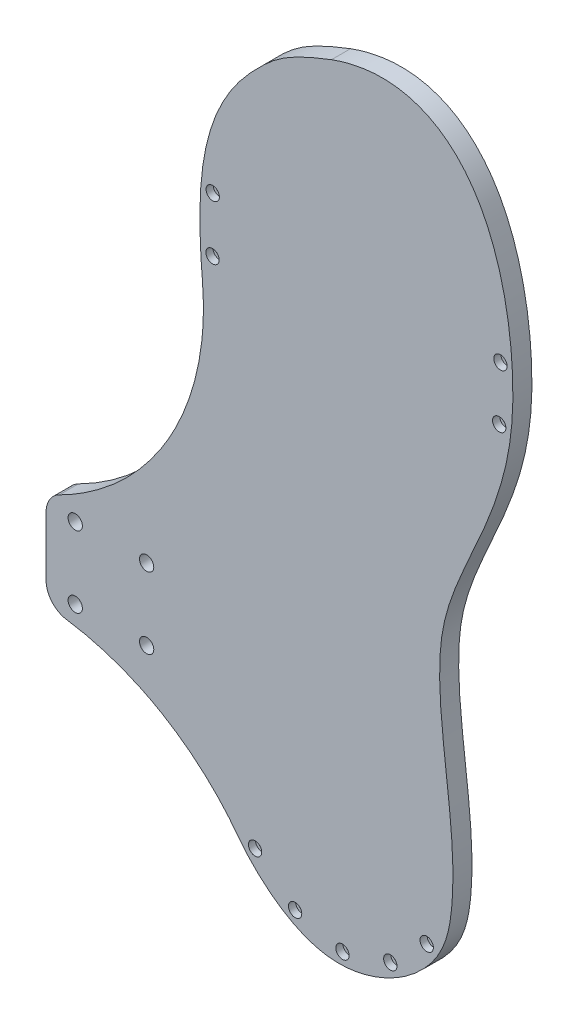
ISO-10303-21;
HEADER;
FILE_DESCRIPTION(('STEP AP214'),'2;1');
FILE_NAME('part.step','',(''),(''),'','','');
FILE_SCHEMA(('AUTOMOTIVE_DESIGN { 1 0 10303 214 1 1 1 1 }'));
ENDSEC;
DATA;
#1=APPLICATION_CONTEXT('core data for automotive mechanical design processes');
#2=APPLICATION_PROTOCOL_DEFINITION('international standard','automotive_design',2000,#1);
#3=PRODUCT_CONTEXT('',#1,'mechanical');
#4=PRODUCT('Part','Part','',(#3));
#5=PRODUCT_RELATED_PRODUCT_CATEGORY('part','',(#4));
#6=PRODUCT_DEFINITION_FORMATION('','',#4);
#7=PRODUCT_DEFINITION_CONTEXT('part definition',#1,'design');
#8=PRODUCT_DEFINITION('design','',#6,#7);
#9=PRODUCT_DEFINITION_SHAPE('','',#8);
#10=(LENGTH_UNIT() NAMED_UNIT(*) SI_UNIT(.MILLI.,.METRE.));
#11=(NAMED_UNIT(*) PLANE_ANGLE_UNIT() SI_UNIT($,.RADIAN.));
#12=(NAMED_UNIT(*) SI_UNIT($,.STERADIAN.) SOLID_ANGLE_UNIT());
#13=UNCERTAINTY_MEASURE_WITH_UNIT(LENGTH_MEASURE(1.E-05),#10,'distance_accuracy_value','');
#14=(GEOMETRIC_REPRESENTATION_CONTEXT(3) GLOBAL_UNCERTAINTY_ASSIGNED_CONTEXT((#13)) GLOBAL_UNIT_ASSIGNED_CONTEXT((#10,
#11,#12)) REPRESENTATION_CONTEXT('',''));
#15=CARTESIAN_POINT('',(0.,0.,0.));
#16=DIRECTION('',(0.,0.,1.));
#17=DIRECTION('',(1.,0.,0.));
#18=AXIS2_PLACEMENT_3D('',#15,#16,#17);
#19=CARTESIAN_POINT('',(1.94084444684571,155.383987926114,-15.));
#20=DIRECTION('',(0.,0.,1.));
#21=DIRECTION('',(1.,0.,0.));
#22=AXIS2_PLACEMENT_3D('',#19,#20,#21);
#23=PLANE('',#22);
#24=CARTESIAN_POINT('',(-86.129,94.9752433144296,-15.));
#25=DIRECTION('',(0.,0.,-1.));
#26=DIRECTION('',(-1.,0.,0.));
#27=AXIS2_PLACEMENT_3D('',#24,#25,#26);
#28=CIRCLE('',#27,3.);
#29=CARTESIAN_POINT('',(-83.129,94.9752433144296,-15.));
#30=VERTEX_POINT('',#29);
#31=EDGE_CURVE('E707',#30,#30,#28,.T.);
#32=ORIENTED_EDGE('',*,*,#31,.F.);
#33=EDGE_LOOP('',(#32));
#34=FACE_BOUND('',#33,.T.);
#35=CARTESIAN_POINT('',(-116.129,94.9752433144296,-15.));
#36=DIRECTION('',(0.,0.,-1.));
#37=DIRECTION('',(-1.,0.,0.));
#38=AXIS2_PLACEMENT_3D('',#35,#36,#37);
#39=CIRCLE('',#38,3.);
#40=CARTESIAN_POINT('',(-113.129,94.9752433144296,-15.));
#41=VERTEX_POINT('',#40);
#42=EDGE_CURVE('E385',#41,#41,#39,.T.);
#43=ORIENTED_EDGE('',*,*,#42,.F.);
#44=EDGE_LOOP('',(#43));
#45=FACE_BOUND('',#44,.T.);
#46=CARTESIAN_POINT('',(-86.129,64.9752433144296,-15.));
#47=DIRECTION('',(0.,0.,-1.));
#48=DIRECTION('',(-1.,0.,0.));
#49=AXIS2_PLACEMENT_3D('',#46,#47,#48);
#50=CIRCLE('',#49,3.);
#51=CARTESIAN_POINT('',(-83.129,64.9752433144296,-15.));
#52=VERTEX_POINT('',#51);
#53=EDGE_CURVE('E475',#52,#52,#50,.T.);
#54=ORIENTED_EDGE('',*,*,#53,.F.);
#55=EDGE_LOOP('',(#54));
#56=FACE_BOUND('',#55,.T.);
#57=CARTESIAN_POINT('',(-116.129,64.9752433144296,-15.));
#58=DIRECTION('',(0.,0.,-1.));
#59=DIRECTION('',(-1.,0.,0.));
#60=AXIS2_PLACEMENT_3D('',#57,#58,#59);
#61=CIRCLE('',#60,3.);
#62=CARTESIAN_POINT('',(-113.129,64.9752433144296,-15.));
#63=VERTEX_POINT('',#62);
#64=EDGE_CURVE('E432',#63,#63,#61,.T.);
#65=ORIENTED_EDGE('',*,*,#64,.F.);
#66=EDGE_LOOP('',(#65));
#67=FACE_BOUND('',#66,.T.);
#68=CARTESIAN_POINT('',(-3.83294470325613,-5.3362918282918,-15.));
#69=DIRECTION('',(0.,0.,-1.));
#70=DIRECTION('',(-1.,0.,0.));
#71=AXIS2_PLACEMENT_3D('',#68,#69,#70);
#72=CIRCLE('',#71,2.8);
#73=CARTESIAN_POINT('',(-1.03294470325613,-5.3362918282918,-15.));
#74=VERTEX_POINT('',#73);
#75=EDGE_CURVE('E815',#74,#74,#72,.T.);
#76=ORIENTED_EDGE('',*,*,#75,.F.);
#77=EDGE_LOOP('',(#76));
#78=FACE_BOUND('',#77,.T.);
#79=CARTESIAN_POINT('',(-23.7258030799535,-0.0933838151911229,-15.));
#80=DIRECTION('',(0.,0.,-1.));
#81=DIRECTION('',(-0.847180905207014,0.53130453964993,0.));
#82=AXIS2_PLACEMENT_3D('',#79,#80,#81);
#83=CIRCLE('',#82,2.8);
#84=CARTESIAN_POINT('',(-21.3536965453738,-1.58103652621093,-15.));
#85=VERTEX_POINT('',#84);
#86=EDGE_CURVE('E538',#85,#85,#83,.T.);
#87=ORIENTED_EDGE('',*,*,#86,.F.);
#88=EDGE_LOOP('',(#87));
#89=FACE_BOUND('',#88,.T.);
#90=CARTESIAN_POINT('',(16.2886261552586,0.836239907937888,-15.));
#91=DIRECTION('',(0.,0.,-1.));
#92=DIRECTION('',(-0.885748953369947,-0.464164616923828,0.));
#93=AXIS2_PLACEMENT_3D('',#90,#91,#92);
#94=CIRCLE('',#93,2.8);
#95=CARTESIAN_POINT('',(18.7687232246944,2.13590083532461,-15.));
#96=VERTEX_POINT('',#95);
#97=EDGE_CURVE('E564',#96,#96,#94,.T.);
#98=ORIENTED_EDGE('',*,*,#97,.F.);
#99=EDGE_LOOP('',(#98));
#100=FACE_BOUND('',#99,.T.);
#101=CARTESIAN_POINT('',(-40.5488069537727,13.8937911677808,-15.));
#102=DIRECTION('',(0.,0.,-1.));
#103=DIRECTION('',(-0.624379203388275,0.781121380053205,0.));
#104=AXIS2_PLACEMENT_3D('',#101,#102,#103);
#105=CIRCLE('',#104,2.8);
#106=CARTESIAN_POINT('',(-38.8005451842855,11.7066513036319,-15.));
#107=VERTEX_POINT('',#106);
#108=EDGE_CURVE('E584',#107,#107,#105,.T.);
#109=ORIENTED_EDGE('',*,*,#108,.F.);
#110=EDGE_LOOP('',(#109));
#111=FACE_BOUND('',#110,.T.);
#112=CARTESIAN_POINT('',(31.5818630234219,15.2204904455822,-15.));
#113=DIRECTION('',(0.,0.,-1.));
#114=DIRECTION('',(-0.561587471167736,-0.827417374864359,0.));
#115=AXIS2_PLACEMENT_3D('',#112,#113,#114);
#116=CIRCLE('',#115,2.8);
#117=CARTESIAN_POINT('',(33.1543079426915,17.5372590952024,-15.));
#118=VERTEX_POINT('',#117);
#119=EDGE_CURVE('E485',#118,#118,#116,.T.);
#120=ORIENTED_EDGE('',*,*,#119,.F.);
#121=EDGE_LOOP('',(#120));
#122=FACE_BOUND('',#121,.T.);
#123=CARTESIAN_POINT('',(62.0623026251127,219.590369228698,-15.));
#124=DIRECTION('',(0.,0.,-1.));
#125=DIRECTION('',(-0.154847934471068,-0.98793831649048,0.));
#126=AXIS2_PLACEMENT_3D('',#123,#124,#125);
#127=CIRCLE('',#126,2.8);
#128=CARTESIAN_POINT('',(62.4958768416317,222.356596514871,-15.));
#129=VERTEX_POINT('',#128);
#130=EDGE_CURVE('E411',#129,#129,#127,.T.);
#131=ORIENTED_EDGE('',*,*,#130,.F.);
#132=EDGE_LOOP('',(#131));
#133=FACE_BOUND('',#132,.T.);
#134=CARTESIAN_POINT('',(62.5687850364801,242.371560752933,-15.));
#135=DIRECTION('',(0.,0.,-1.));
#136=DIRECTION('',(0.0135958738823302,-0.999907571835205,0.));
#137=AXIS2_PLACEMENT_3D('',#134,#135,#136);
#138=CIRCLE('',#137,2.8);
#139=CARTESIAN_POINT('',(62.5307165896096,245.171301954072,-15.));
#140=VERTEX_POINT('',#139);
#141=EDGE_CURVE('E402',#140,#140,#138,.T.);
#142=ORIENTED_EDGE('',*,*,#141,.F.);
#143=EDGE_LOOP('',(#142));
#144=FACE_BOUND('',#143,.T.);
#145=CARTESIAN_POINT('',(-58.4414908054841,220.506879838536,-15.));
#146=DIRECTION('',(0.,0.,-1.));
#147=DIRECTION('',(-0.00920865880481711,0.999957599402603,0.));
#148=AXIS2_PLACEMENT_3D('',#145,#146,#147);
#149=CIRCLE('',#148,2.8);
#150=CARTESIAN_POINT('',(-58.4157065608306,217.706998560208,-15.));
#151=VERTEX_POINT('',#150);
#152=EDGE_CURVE('E456',#151,#151,#149,.T.);
#153=ORIENTED_EDGE('',*,*,#152,.F.);
#154=EDGE_LOOP('',(#153));
#155=FACE_BOUND('',#154,.T.);
#156=CARTESIAN_POINT('',(-58.3438057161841,243.504826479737,-15.));
#157=DIRECTION('',(0.,0.,-1.));
#158=DIRECTION('',(0.119499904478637,0.992834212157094,0.));
#159=AXIS2_PLACEMENT_3D('',#156,#157,#158);
#160=CIRCLE('',#159,2.8);
#161=CARTESIAN_POINT('',(-58.6784054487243,240.724890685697,-15.));
#162=VERTEX_POINT('',#161);
#163=EDGE_CURVE('E452',#162,#162,#160,.T.);
#164=ORIENTED_EDGE('',*,*,#163,.F.);
#165=EDGE_LOOP('',(#164));
#166=FACE_BOUND('',#165,.T.);
#167=CARTESIAN_POINT('',(-47.4752263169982,14.5148908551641,-15.));
#168=CARTESIAN_POINT('',(-45.6840671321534,12.114550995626,-15.));
#169=CARTESIAN_POINT('',(-43.550681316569,9.63341482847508,-15.));
#170=CARTESIAN_POINT('',(-41.1007198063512,7.15773987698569,-15.));
#171=CARTESIAN_POINT('',(-37.0269391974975,3.04120311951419,-15.));
#172=CARTESIAN_POINT('',(-32.1012798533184,-1.05040588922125,-15.));
#173=CARTESIAN_POINT('',(-26.3957403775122,-4.32180779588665,-15.));
#174=CARTESIAN_POINT('',(-21.8965654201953,-6.90151293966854,-15.));
#175=CARTESIAN_POINT('',(-16.8879989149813,-8.99073442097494,-15.));
#176=CARTESIAN_POINT('',(-11.3622529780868,-9.88790347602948,-15.));
#177=CARTESIAN_POINT('',(-7.13301842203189,-10.5745688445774,-15.));
#178=CARTESIAN_POINT('',(-2.96875419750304,-10.4769775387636,-15.));
#179=CARTESIAN_POINT('',(0.979293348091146,-9.87349803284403,-15.));
#180=CARTESIAN_POINT('',(3.1304261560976,-9.54468624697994,-15.));
#181=CARTESIAN_POINT('',(5.2430597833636,-9.06347578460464,-15.));
#182=CARTESIAN_POINT('',(7.30607373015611,-8.45218045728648,-15.));
#183=CARTESIAN_POINT('',(14.0197239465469,-6.46284683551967,-15.));
#184=CARTESIAN_POINT('',(20.2185556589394,-3.13129152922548,-15.));
#185=CARTESIAN_POINT('',(25.5176313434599,1.13104303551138,-15.));
#186=CARTESIAN_POINT('',(30.1964873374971,4.89450119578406,-15.));
#187=CARTESIAN_POINT('',(34.1992657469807,9.38962982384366,-15.));
#188=CARTESIAN_POINT('',(37.0100308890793,14.6409512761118,-15.));
#189=CARTESIAN_POINT('',(37.880172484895,16.2666272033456,-15.));
#190=CARTESIAN_POINT('',(38.5992603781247,17.90877574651,-15.));
#191=CARTESIAN_POINT('',(39.1921043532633,19.5365400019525,-15.));
#192=CARTESIAN_POINT('',(40.7566668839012,23.8323396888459,-15.));
#193=CARTESIAN_POINT('',(41.4504255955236,27.9899491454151,-15.));
#194=CARTESIAN_POINT('',(41.8924577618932,31.8267851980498,-15.));
#195=CARTESIAN_POINT('',(43.1077586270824,42.3755880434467,-15.));
#196=CARTESIAN_POINT('',(42.6405304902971,53.1653539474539,-15.));
#197=CARTESIAN_POINT('',(41.6791689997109,63.9179666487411,-15.));
#198=CARTESIAN_POINT('',(40.5314690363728,76.7547333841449,-15.));
#199=CARTESIAN_POINT('',(38.6609828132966,89.5650865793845,-15.));
#200=CARTESIAN_POINT('',(37.6791506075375,101.625145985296,-15.));
#201=CARTESIAN_POINT('',(36.7928407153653,112.511883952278,-15.));
#202=CARTESIAN_POINT('',(36.651122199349,122.757744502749,-15.));
#203=CARTESIAN_POINT('',(38.1156761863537,131.689707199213,-15.));
#204=CARTESIAN_POINT('',(39.3592116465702,139.273731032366,-15.));
#205=CARTESIAN_POINT('',(41.8448733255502,146.598043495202,-15.));
#206=CARTESIAN_POINT('',(45.00721372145,154.243394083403,-15.));
#207=CARTESIAN_POINT('',(48.6747185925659,163.110042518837,-15.));
#208=CARTESIAN_POINT('',(53.2603359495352,172.366706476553,-15.));
#209=CARTESIAN_POINT('',(57.4143938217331,182.734162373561,-15.));
#210=CARTESIAN_POINT('',(61.8250392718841,193.741994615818,-15.));
#211=CARTESIAN_POINT('',(65.7158514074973,206.046418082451,-15.));
#212=CARTESIAN_POINT('',(67.1622828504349,220.297796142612,-15.));
#213=CARTESIAN_POINT('',(68.0151034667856,228.700454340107,-15.));
#214=CARTESIAN_POINT('',(68.0117687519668,237.572765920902,-15.));
#215=CARTESIAN_POINT('',(67.2844237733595,246.605480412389,-15.));
#216=CARTESIAN_POINT('',(66.3816558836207,257.816727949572,-15.));
#217=CARTESIAN_POINT('',(64.3667997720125,269.437061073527,-15.));
#218=CARTESIAN_POINT('',(60.6898218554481,280.253058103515,-15.));
#219=CARTESIAN_POINT('',(57.7810514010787,288.809338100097,-15.));
#220=CARTESIAN_POINT('',(53.8358320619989,296.896661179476,-15.));
#221=CARTESIAN_POINT('',(48.2966455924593,303.761737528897,-15.));
#222=CARTESIAN_POINT('',(44.2704984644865,308.751605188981,-15.));
#223=CARTESIAN_POINT('',(39.3568130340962,313.092345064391,-15.));
#224=CARTESIAN_POINT('',(33.4923756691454,316.179755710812,-15.));
#225=CARTESIAN_POINT('',(27.8907084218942,319.128827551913,-15.));
#226=CARTESIAN_POINT('',(21.4495625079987,320.875207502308,-15.));
#227=CARTESIAN_POINT('',(14.5411707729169,321.103995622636,-15.));
#228=CARTESIAN_POINT('',(7.33804130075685,321.342544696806,-15.));
#229=CARTESIAN_POINT('',(-0.333947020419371,319.98188295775,-15.));
#230=CARTESIAN_POINT('',(-8.4367493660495,317.032704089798,-15.));
#231=(BOUNDED_CURVE() B_SPLINE_CURVE(3,(#167,#168,#169,#170,#171,#172,#173,#174,#175,#176,#177,
#178,#179,#180,#181,#182,#183,#184,#185,#186,#187,#188,#189,#190,#191,#192,#193,#194,#195,#196,
#197,#198,#199,#200,#201,#202,#203,#204,#205,#206,#207,#208,#209,#210,#211,#212,#213,#214,#215,
#216,#217,#218,#219,#220,#221,#222,#223,#224,#225,#226,#227,#228,#229,#230),.UNSPECIFIED.,.F.,
.F.) B_SPLINE_CURVE_WITH_KNOTS((4,3,3,3,3,3,3,3,3,3,3,3,3,3,3,3,3,3,3,3,3,4),
(-0.562121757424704,-0.549804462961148,-0.529323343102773,-0.513172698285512,-0.500811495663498,
-0.494076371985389,-0.472158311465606,-0.452805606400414,-0.446814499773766,-0.43100349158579,
-0.387533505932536,-0.335637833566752,-0.288791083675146,-0.249014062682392,-0.202882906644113,
-0.153902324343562,-0.125023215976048,-0.089178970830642,-0.060823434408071,-0.0402132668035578,
-0.020526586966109,0.),
.UNSPECIFIED.) CURVE() GEOMETRIC_REPRESENTATION_ITEM() RATIONAL_B_SPLINE_CURVE((1.,1.,1.,1.,1.,
1.,1.,1.,1.,1.,1.,1.,1.,1.,1.,1.,1.,1.,1.,1.,1.,1.,1.,1.,1.,1.,1.,1.,1.,1.,1.,1.,1.,1.,1.,1.,1.,
1.,1.,1.,1.,1.,1.,1.,1.,1.,1.,1.,1.,1.,1.,1.,1.,1.,1.,1.,1.,1.,1.,1.,1.,1.,1.,1.)) REPRESENTATION_ITEM(''));
#232=CARTESIAN_POINT('',(-47.4752263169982,14.5148908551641,-15.));
#233=VERTEX_POINT('',#232);
#234=CARTESIAN_POINT('',(-8.4367493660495,317.032704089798,-15.));
#235=VERTEX_POINT('',#234);
#236=EDGE_CURVE('E490',#233,#235,#231,.T.);
#237=ORIENTED_EDGE('',*,*,#236,.F.);
#238=CARTESIAN_POINT('',(-119.817026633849,57.5855918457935,-15.));
#239=CARTESIAN_POINT('',(-111.674318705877,56.4023506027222,-15.));
#240=CARTESIAN_POINT('',(-95.6582875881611,52.198538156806,-15.));
#241=CARTESIAN_POINT('',(-69.9591833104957,38.7980150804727,-15.));
#242=CARTESIAN_POINT('',(-54.8566210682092,24.4067286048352,-15.));
#243=CARTESIAN_POINT('',(-47.4752263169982,14.5148908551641,-15.));
#244=(BOUNDED_CURVE() B_SPLINE_CURVE(3,(#238,#239,#240,#241,#242,#243),.UNSPECIFIED.,.F.,
.F.) B_SPLINE_CURVE_WITH_KNOTS((4,1,1,4),(0.,0.285714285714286,0.571428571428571,1.),
.UNSPECIFIED.) CURVE() GEOMETRIC_REPRESENTATION_ITEM() RATIONAL_B_SPLINE_CURVE((1.,1.,1.,1.,1.,1.)) REPRESENTATION_ITEM(''));
#245=CARTESIAN_POINT('',(-119.817026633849,57.5855918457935,-15.));
#246=VERTEX_POINT('',#245);
#247=EDGE_CURVE('E669',#246,#233,#244,.T.);
#248=ORIENTED_EDGE('',*,*,#247,.F.);
#249=CARTESIAN_POINT('',(-118.379,67.481655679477,-15.));
#250=DIRECTION('',(0.,0.,1.));
#251=DIRECTION('',(-1.,0.,0.));
#252=AXIS2_PLACEMENT_3D('',#249,#250,#251);
#253=CIRCLE('',#252,10.);
#254=CARTESIAN_POINT('',(-128.379,67.4816556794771,-15.));
#255=VERTEX_POINT('',#254);
#256=EDGE_CURVE('E746',#255,#246,#253,.T.);
#257=ORIENTED_EDGE('',*,*,#256,.F.);
#258=DIRECTION('',(0.,1.,0.));
#259=VECTOR('',#258,1.);
#260=CARTESIAN_POINT('',(-128.379,67.4816556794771,-15.));
#261=LINE('',#260,#259);
#262=CARTESIAN_POINT('',(-128.379,92.4816556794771,-15.));
#263=VERTEX_POINT('',#262);
#264=EDGE_CURVE('E462',#255,#263,#261,.T.);
#265=ORIENTED_EDGE('',*,*,#264,.T.);
#266=CARTESIAN_POINT('',(-118.379,92.4816556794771,-15.));
#267=DIRECTION('',(0.,0.,1.));
#268=DIRECTION('',(0.,1.,0.));
#269=AXIS2_PLACEMENT_3D('',#266,#267,#268);
#270=CIRCLE('',#269,10.);
#271=CARTESIAN_POINT('',(-122.867005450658,101.417975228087,-15.));
#272=VERTEX_POINT('',#271);
#273=EDGE_CURVE('E474',#272,#263,#270,.T.);
#274=ORIENTED_EDGE('',*,*,#273,.F.);
#275=CARTESIAN_POINT('',(-122.867005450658,101.417975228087,-15.));
#276=CARTESIAN_POINT('',(-111.704400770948,107.024067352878,-15.));
#277=CARTESIAN_POINT('',(-91.3096794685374,122.074047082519,-15.));
#278=CARTESIAN_POINT('',(-70.0158615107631,153.57476008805,-15.));
#279=CARTESIAN_POINT('',(-62.0662260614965,184.244883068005,-15.));
#280=CARTESIAN_POINT('',(-62.1083309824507,203.050712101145,-15.));
#281=CARTESIAN_POINT('',(-62.6508641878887,209.272742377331,-15.));
#282=(BOUNDED_CURVE() B_SPLINE_CURVE(3,(#275,#276,#277,#278,#279,#280,#281),.UNSPECIFIED.,.F.,
.F.) B_SPLINE_CURVE_WITH_KNOTS((4,1,1,1,4),(0.,0.285714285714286,0.571428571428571,
0.857142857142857,1.),
.UNSPECIFIED.) CURVE() GEOMETRIC_REPRESENTATION_ITEM() RATIONAL_B_SPLINE_CURVE((1.,1.,1.,1.,1.,
1.,1.)) REPRESENTATION_ITEM(''));
#283=CARTESIAN_POINT('',(-62.6508641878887,209.272742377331,-15.));
#284=VERTEX_POINT('',#283);
#285=EDGE_CURVE('E11',#272,#284,#282,.T.);
#286=ORIENTED_EDGE('',*,*,#285,.T.);
#287=CARTESIAN_POINT('',(-8.43674936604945,317.032704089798,-15.));
#288=CARTESIAN_POINT('',(-10.2162263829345,316.385027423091,-15.));
#289=CARTESIAN_POINT('',(-11.9386894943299,315.690937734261,-15.));
#290=CARTESIAN_POINT('',(-13.4860256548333,315.050339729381,-15.));
#291=CARTESIAN_POINT('',(-16.2347371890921,313.912371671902,-15.));
#292=CARTESIAN_POINT('',(-18.6301969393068,312.856818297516,-15.));
#293=CARTESIAN_POINT('',(-20.7797258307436,311.829499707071,-15.));
#294=CARTESIAN_POINT('',(-24.5302242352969,310.03703404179,-15.));
#295=CARTESIAN_POINT('',(-27.5641170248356,308.306746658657,-15.));
#296=CARTESIAN_POINT('',(-30.2151096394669,306.453478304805,-15.));
#297=CARTESIAN_POINT('',(-32.8871473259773,304.585497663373,-15.));
#298=CARTESIAN_POINT('',(-35.0956116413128,302.638037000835,-15.));
#299=CARTESIAN_POINT('',(-37.1647854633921,300.668232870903,-15.));
#300=CARTESIAN_POINT('',(-40.3894135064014,297.59846387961,-15.));
#301=CARTESIAN_POINT('',(-43.9784611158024,293.848021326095,-15.));
#302=CARTESIAN_POINT('',(-47.2168175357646,289.643860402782,-15.));
#303=CARTESIAN_POINT('',(-52.3918558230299,282.925423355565,-15.));
#304=CARTESIAN_POINT('',(-56.1822830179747,275.564412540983,-15.));
#305=CARTESIAN_POINT('',(-58.7712543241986,267.764351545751,-15.));
#306=CARTESIAN_POINT('',(-61.9621685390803,258.150755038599,-15.));
#307=CARTESIAN_POINT('',(-63.3642763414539,247.908163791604,-15.));
#308=CARTESIAN_POINT('',(-63.6826120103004,237.018282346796,-15.));
#309=CARTESIAN_POINT('',(-63.938895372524,228.251135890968,-15.));
#310=CARTESIAN_POINT('',(-63.5026633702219,219.041582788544,-15.));
#311=CARTESIAN_POINT('',(-62.6508641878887,209.272742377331,-15.));
#312=(BOUNDED_CURVE() B_SPLINE_CURVE(3,(#287,#288,#289,#290,#291,#292,#293,#294,#295,#296,#297,
#298,#299,#300,#301,#302,#303,#304,#305,#306,#307,#308,#309,#310,#311),.UNSPECIFIED.,.F.,
.F.) B_SPLINE_CURVE_WITH_KNOTS((4,3,3,3,3,3,3,3,4),(-1.,-0.995492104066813,-0.987484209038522,
-0.973512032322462,-0.959428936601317,-0.937481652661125,-0.902408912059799,-0.859181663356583,
-0.824380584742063),
.UNSPECIFIED.) CURVE() GEOMETRIC_REPRESENTATION_ITEM() RATIONAL_B_SPLINE_CURVE((1.,1.,1.,1.,1.,
1.,1.,1.,1.,1.,1.,1.,1.,1.,1.,1.,1.,1.,1.,1.,1.,1.,1.,1.,1.)) REPRESENTATION_ITEM(''));
#313=EDGE_CURVE('E598',#235,#284,#312,.T.);
#314=ORIENTED_EDGE('',*,*,#313,.F.);
#315=EDGE_LOOP('',(#237,#248,#257,#265,#274,#286,#314));
#316=FACE_BOUND('',#315,.T.);
#317=ADVANCED_FACE('F17',(#34,#45,#56,#67,#78,#89,#100,#111,#122,#133,#144,#155,#166,#316),#23,.F.);
#318=CARTESIAN_POINT('',(-122.867005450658,101.417975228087,-15.));
#319=CARTESIAN_POINT('',(-122.867005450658,101.417975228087,-12.3333333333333));
#320=CARTESIAN_POINT('',(-122.867005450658,101.417975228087,-9.66666666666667));
#321=CARTESIAN_POINT('',(-122.867005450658,101.417975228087,-7.));
#322=CARTESIAN_POINT('',(-111.704400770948,107.024067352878,-15.));
#323=CARTESIAN_POINT('',(-111.704400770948,107.024067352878,-12.3333333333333));
#324=CARTESIAN_POINT('',(-111.704400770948,107.024067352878,-9.66666666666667));
#325=CARTESIAN_POINT('',(-111.704400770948,107.024067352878,-7.));
#326=CARTESIAN_POINT('',(-91.3096794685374,122.074047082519,-15.));
#327=CARTESIAN_POINT('',(-91.3096794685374,122.074047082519,-12.3333333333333));
#328=CARTESIAN_POINT('',(-91.3096794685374,122.074047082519,-9.66666666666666));
#329=CARTESIAN_POINT('',(-91.3096794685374,122.074047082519,-7.));
#330=CARTESIAN_POINT('',(-70.0158615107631,153.57476008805,-15.));
#331=CARTESIAN_POINT('',(-70.0158615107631,153.57476008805,-12.3333333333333));
#332=CARTESIAN_POINT('',(-70.0158615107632,153.57476008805,-9.66666666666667));
#333=CARTESIAN_POINT('',(-70.0158615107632,153.57476008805,-7.));
#334=CARTESIAN_POINT('',(-62.0662260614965,184.244883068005,-15.));
#335=CARTESIAN_POINT('',(-62.0662260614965,184.244883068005,-12.3333333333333));
#336=CARTESIAN_POINT('',(-62.0662260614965,184.244883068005,-9.66666666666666));
#337=CARTESIAN_POINT('',(-62.0662260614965,184.244883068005,-7.));
#338=CARTESIAN_POINT('',(-62.1083309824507,203.050712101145,-15.));
#339=CARTESIAN_POINT('',(-62.1083309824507,203.050712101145,-12.3333333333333));
#340=CARTESIAN_POINT('',(-62.1083309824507,203.050712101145,-9.66666666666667));
#341=CARTESIAN_POINT('',(-62.1083309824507,203.050712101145,-7.));
#342=CARTESIAN_POINT('',(-62.6508641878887,209.272742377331,-15.));
#343=CARTESIAN_POINT('',(-62.6508641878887,209.272742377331,-12.3333333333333));
#344=CARTESIAN_POINT('',(-62.6508641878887,209.272742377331,-9.66666666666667));
#345=CARTESIAN_POINT('',(-62.6508641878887,209.272742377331,-7.));
#346=(BOUNDED_SURFACE() B_SPLINE_SURFACE(3,3,((#318,#319,#320,#321),(#322,#323,#324,#325),(#326,
#327,#328,#329),(#330,#331,#332,#333),(#334,#335,#336,#337),(#338,#339,#340,#341),(#342,#343,
#344,#345)),.UNSPECIFIED.,.F.,.F.,.F.) B_SPLINE_SURFACE_WITH_KNOTS((4,1,1,1,4),(4,4),(0.,
0.285714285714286,0.571428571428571,0.857142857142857,1.),(0.,0.8),
.UNSPECIFIED.) GEOMETRIC_REPRESENTATION_ITEM() RATIONAL_B_SPLINE_SURFACE(((1.,1.,1.,1.),(1.,1.,
1.,1.),(1.,1.,1.,1.),(1.,1.,1.,1.),(1.,1.,1.,1.),(1.,1.,1.,1.),(1.,1.,1.,1.))) REPRESENTATION_ITEM('') SURFACE());
#347=CARTESIAN_POINT('',(-62.6508641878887,209.272742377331,-7.));
#348=CARTESIAN_POINT('',(-62.1083309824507,203.050712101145,-7.));
#349=CARTESIAN_POINT('',(-62.0942960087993,196.782102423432,-7.));
#350=CARTESIAN_POINT('',(-62.6149150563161,190.558354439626,-7.));
#351=CARTESIAN_POINT('',(-63.6561531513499,178.110858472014,-7.));
#352=CARTESIAN_POINT('',(-66.8360073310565,165.842809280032,-7.));
#353=CARTESIAN_POINT('',(-71.9749040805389,154.458665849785,-7.));
#354=CARTESIAN_POINT('',(-74.2403052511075,149.440146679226,-7.));
#355=CARTESIAN_POINT('',(-76.8864164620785,144.593401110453,-7.));
#356=CARTESIAN_POINT('',(-79.8781704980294,139.970149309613,-7.));
#357=(BOUNDED_CURVE() B_SPLINE_CURVE(3,(#347,#348,#349,#350,#351,#352,#353,#354,#355,#356),
.UNSPECIFIED.,.F.,.F.) B_SPLINE_CURVE_WITH_KNOTS((4,3,3,4),(-12.6630691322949,-10.7834909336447,
-7.02433453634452,-5.36717002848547),
.UNSPECIFIED.) CURVE() GEOMETRIC_REPRESENTATION_ITEM() RATIONAL_B_SPLINE_CURVE((1.,1.,1.,1.,1.,
1.,1.,1.,1.,1.)) REPRESENTATION_ITEM(''));
#358=CARTESIAN_POINT('',(-62.6508641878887,209.272742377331,-7.));
#359=VERTEX_POINT('',#358);
#360=CARTESIAN_POINT('',(-79.876727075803,139.96853764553,-7.));
#361=VERTEX_POINT('',#360);
#362=EDGE_CURVE('E610',#359,#361,#357,.T.);
#363=CARTESIAN_POINT('',(-62.6508641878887,209.272742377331,-15.));
#364=CARTESIAN_POINT('',(-62.6508641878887,209.272742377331,-12.3333333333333));
#365=CARTESIAN_POINT('',(-62.6508641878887,209.272742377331,-9.66666666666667));
#366=CARTESIAN_POINT('',(-62.6508641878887,209.272742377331,-7.));
#367=(BOUNDED_CURVE() B_SPLINE_CURVE(3,(#363,#364,#365,#366),.UNSPECIFIED.,.F.,
.F.) B_SPLINE_CURVE_WITH_KNOTS((4,4),(0.,0.8),
.UNSPECIFIED.) CURVE() GEOMETRIC_REPRESENTATION_ITEM() RATIONAL_B_SPLINE_CURVE((1.,1.,1.,1.)) REPRESENTATION_ITEM(''));
#368=EDGE_CURVE('E32',#284,#359,#367,.T.);
#369=CARTESIAN_POINT('',(-122.867005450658,101.417975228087,-7.));
#370=CARTESIAN_POINT('',(-122.867005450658,101.417975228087,-9.66666666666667));
#371=CARTESIAN_POINT('',(-122.867005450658,101.417975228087,-12.3333333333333));
#372=CARTESIAN_POINT('',(-122.867005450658,101.417975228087,-15.));
#373=(BOUNDED_CURVE() B_SPLINE_CURVE(3,(#369,#370,#371,#372),.UNSPECIFIED.,.F.,
.F.) B_SPLINE_CURVE_WITH_KNOTS((4,4),(-0.8,0.),
.UNSPECIFIED.) CURVE() GEOMETRIC_REPRESENTATION_ITEM() RATIONAL_B_SPLINE_CURVE((1.,1.,1.,1.)) REPRESENTATION_ITEM(''));
#374=CARTESIAN_POINT('',(-122.867005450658,101.417975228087,-7.));
#375=VERTEX_POINT('',#374);
#376=EDGE_CURVE('E774',#375,#272,#373,.T.);
#377=CARTESIAN_POINT('',(-79.8781704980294,139.970149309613,-7.));
#378=CARTESIAN_POINT('',(-83.6729915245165,134.105892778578,-7.));
#379=CARTESIAN_POINT('',(-88.0239195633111,128.601216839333,-7.));
#380=CARTESIAN_POINT('',(-92.8593901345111,123.561670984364,-7.));
#381=CARTESIAN_POINT('',(-101.507040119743,114.549057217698,-7.));
#382=CARTESIAN_POINT('',(-111.704400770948,107.024067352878,-7.));
#383=CARTESIAN_POINT('',(-122.867005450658,101.417975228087,-7.));
#384=(BOUNDED_CURVE() B_SPLINE_CURVE(3,(#377,#378,#379,#380,#381,#382,#383),.UNSPECIFIED.,.F.,
.F.) B_SPLINE_CURVE_WITH_KNOTS((4,3,4),(-5.85810588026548,-3.75450963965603,
0.00751594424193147),
.UNSPECIFIED.) CURVE() GEOMETRIC_REPRESENTATION_ITEM() RATIONAL_B_SPLINE_CURVE((1.,1.,1.,1.,1.,
1.,1.)) REPRESENTATION_ITEM(''));
#385=EDGE_CURVE('E620',#361,#375,#384,.T.);
#386=ORIENTED_EDGE('',*,*,#362,.F.);
#387=ORIENTED_EDGE('',*,*,#368,.F.);
#388=ORIENTED_EDGE('',*,*,#285,.F.);
#389=ORIENTED_EDGE('',*,*,#376,.F.);
#390=ORIENTED_EDGE('',*,*,#385,.F.);
#391=EDGE_LOOP('',(#386,#387,#388,#389,#390));
#392=FACE_BOUND('',#391,.T.);
#393=ADVANCED_FACE('F830',(#392),#346,.F.);
#394=CARTESIAN_POINT('',(-8.43674936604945,317.032704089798,0.));
#395=CARTESIAN_POINT('',(-8.43674936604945,317.032704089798,-15.));
#396=CARTESIAN_POINT('',(-10.2162263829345,316.385027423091,0.));
#397=CARTESIAN_POINT('',(-10.2162263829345,316.385027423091,-15.));
#398=CARTESIAN_POINT('',(-11.9386894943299,315.690937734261,0.));
#399=CARTESIAN_POINT('',(-11.9386894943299,315.690937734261,-15.));
#400=CARTESIAN_POINT('',(-13.4860256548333,315.050339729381,0.));
#401=CARTESIAN_POINT('',(-13.4860256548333,315.050339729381,-15.));
#402=CARTESIAN_POINT('',(-16.2347371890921,313.912371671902,0.));
#403=CARTESIAN_POINT('',(-16.2347371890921,313.912371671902,-15.));
#404=CARTESIAN_POINT('',(-18.6301969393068,312.856818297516,0.));
#405=CARTESIAN_POINT('',(-18.6301969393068,312.856818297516,-15.));
#406=CARTESIAN_POINT('',(-20.7797258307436,311.829499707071,0.));
#407=CARTESIAN_POINT('',(-20.7797258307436,311.829499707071,-15.));
#408=CARTESIAN_POINT('',(-24.5302242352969,310.03703404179,0.));
#409=CARTESIAN_POINT('',(-24.5302242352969,310.03703404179,-15.));
#410=CARTESIAN_POINT('',(-27.5641170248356,308.306746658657,0.));
#411=CARTESIAN_POINT('',(-27.5641170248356,308.306746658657,-15.));
#412=CARTESIAN_POINT('',(-30.2151096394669,306.453478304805,0.));
#413=CARTESIAN_POINT('',(-30.2151096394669,306.453478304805,-15.));
#414=CARTESIAN_POINT('',(-32.8871473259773,304.585497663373,0.));
#415=CARTESIAN_POINT('',(-32.8871473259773,304.585497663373,-15.));
#416=CARTESIAN_POINT('',(-35.0956116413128,302.638037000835,0.));
#417=CARTESIAN_POINT('',(-35.0956116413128,302.638037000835,-15.));
#418=CARTESIAN_POINT('',(-37.1647854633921,300.668232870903,0.));
#419=CARTESIAN_POINT('',(-37.1647854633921,300.668232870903,-15.));
#420=CARTESIAN_POINT('',(-40.3894135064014,297.59846387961,0.));
#421=CARTESIAN_POINT('',(-40.3894135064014,297.59846387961,-15.));
#422=CARTESIAN_POINT('',(-43.9784611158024,293.848021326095,0.));
#423=CARTESIAN_POINT('',(-43.9784611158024,293.848021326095,-15.));
#424=CARTESIAN_POINT('',(-47.2168175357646,289.643860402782,0.));
#425=CARTESIAN_POINT('',(-47.2168175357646,289.643860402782,-15.));
#426=CARTESIAN_POINT('',(-52.3918558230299,282.925423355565,0.));
#427=CARTESIAN_POINT('',(-52.3918558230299,282.925423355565,-15.));
#428=CARTESIAN_POINT('',(-56.1822830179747,275.564412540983,0.));
#429=CARTESIAN_POINT('',(-56.1822830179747,275.564412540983,-15.));
#430=CARTESIAN_POINT('',(-58.7712543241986,267.764351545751,0.));
#431=CARTESIAN_POINT('',(-58.7712543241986,267.764351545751,-15.));
#432=CARTESIAN_POINT('',(-61.9621685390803,258.150755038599,0.));
#433=CARTESIAN_POINT('',(-61.9621685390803,258.150755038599,-15.));
#434=CARTESIAN_POINT('',(-63.3642763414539,247.908163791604,0.));
#435=CARTESIAN_POINT('',(-63.3642763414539,247.908163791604,-15.));
#436=CARTESIAN_POINT('',(-63.6826120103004,237.018282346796,0.));
#437=CARTESIAN_POINT('',(-63.6826120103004,237.018282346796,-15.));
#438=CARTESIAN_POINT('',(-63.938895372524,228.251135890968,0.));
#439=CARTESIAN_POINT('',(-63.938895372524,228.251135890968,-15.));
#440=CARTESIAN_POINT('',(-63.5026633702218,219.041582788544,0.));
#441=CARTESIAN_POINT('',(-63.5026633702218,219.041582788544,-15.));
#442=CARTESIAN_POINT('',(-62.6508641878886,209.272742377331,0.));
#443=CARTESIAN_POINT('',(-62.6508641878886,209.272742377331,-15.));
#444=(BOUNDED_SURFACE() B_SPLINE_SURFACE(3,1,((#394,#395),(#396,#397),(#398,#399),(#400,#401),
(#402,#403),(#404,#405),(#406,#407),(#408,#409),(#410,#411),(#412,#413),(#414,#415),(#416,#417),
(#418,#419),(#420,#421),(#422,#423),(#424,#425),(#426,#427),(#428,#429),(#430,#431),(#432,#433),
(#434,#435),(#436,#437),(#438,#439),(#440,#441),(#442,#443)),.UNSPECIFIED.,.F.,.F.,
.F.) B_SPLINE_SURFACE_WITH_KNOTS((4,3,3,3,3,3,3,3,4),(2,2),(-1.,-0.995492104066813,
-0.987484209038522,-0.973512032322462,-0.959428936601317,-0.937481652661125,-0.902408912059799,
-0.859181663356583,-0.824380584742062),(0.,1.5),
.UNSPECIFIED.) GEOMETRIC_REPRESENTATION_ITEM() RATIONAL_B_SPLINE_SURFACE(((1.,1.),(1.,1.),(1.,
1.),(1.,1.),(1.,1.),(1.,1.),(1.,1.),(1.,1.),(1.,1.),(1.,1.),(1.,1.),(1.,1.),(1.,1.),(1.,1.),(1.,
1.),(1.,1.),(1.,1.),(1.,1.),(1.,1.),(1.,1.),(1.,1.),(1.,1.),(1.,1.),(1.,1.),(1.,1.))) REPRESENTATION_ITEM('') SURFACE());
#445=CARTESIAN_POINT('',(-8.43674936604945,317.032704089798,-7.));
#446=CARTESIAN_POINT('',(-10.2162263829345,316.385027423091,-7.));
#447=CARTESIAN_POINT('',(-11.9386894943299,315.690937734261,-7.));
#448=CARTESIAN_POINT('',(-13.4860256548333,315.050339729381,-7.));
#449=CARTESIAN_POINT('',(-16.2347371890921,313.912371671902,-7.));
#450=CARTESIAN_POINT('',(-18.6301969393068,312.856818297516,-7.));
#451=CARTESIAN_POINT('',(-20.7797258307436,311.829499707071,-7.));
#452=CARTESIAN_POINT('',(-24.5302242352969,310.03703404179,-7.));
#453=CARTESIAN_POINT('',(-27.5641170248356,308.306746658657,-7.));
#454=CARTESIAN_POINT('',(-30.2151096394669,306.453478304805,-7.));
#455=CARTESIAN_POINT('',(-32.8871473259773,304.585497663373,-7.));
#456=CARTESIAN_POINT('',(-35.0956116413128,302.638037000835,-7.));
#457=CARTESIAN_POINT('',(-37.1647854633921,300.668232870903,-7.));
#458=CARTESIAN_POINT('',(-40.3894135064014,297.59846387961,-7.));
#459=CARTESIAN_POINT('',(-43.9784611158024,293.848021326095,-7.));
#460=CARTESIAN_POINT('',(-47.2168175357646,289.643860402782,-7.));
#461=CARTESIAN_POINT('',(-52.3918558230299,282.925423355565,-7.));
#462=CARTESIAN_POINT('',(-56.1822830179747,275.564412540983,-7.));
#463=CARTESIAN_POINT('',(-58.7712543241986,267.764351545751,-7.));
#464=CARTESIAN_POINT('',(-61.9621685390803,258.150755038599,-7.));
#465=CARTESIAN_POINT('',(-63.3642763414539,247.908163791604,-7.));
#466=CARTESIAN_POINT('',(-63.6826120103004,237.018282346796,-7.));
#467=CARTESIAN_POINT('',(-63.938895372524,228.251135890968,-7.));
#468=CARTESIAN_POINT('',(-63.5026633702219,219.041582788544,-7.));
#469=CARTESIAN_POINT('',(-62.6508641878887,209.272742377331,-7.));
#470=(BOUNDED_CURVE() B_SPLINE_CURVE(3,(#445,#446,#447,#448,#449,#450,#451,#452,#453,#454,#455,
#456,#457,#458,#459,#460,#461,#462,#463,#464,#465,#466,#467,#468,#469),.UNSPECIFIED.,.F.,
.F.) B_SPLINE_CURVE_WITH_KNOTS((4,3,3,3,3,3,3,3,4),(-13.4125690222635,-13.0682878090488,
-12.456701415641,-11.3896053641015,-10.3140381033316,-8.63785975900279,-5.95925185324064,
-2.65786028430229,0.),
.UNSPECIFIED.) CURVE() GEOMETRIC_REPRESENTATION_ITEM() RATIONAL_B_SPLINE_CURVE((1.,1.,1.,1.,1.,
1.,1.,1.,1.,1.,1.,1.,1.,1.,1.,1.,1.,1.,1.,1.,1.,1.,1.,1.,1.)) REPRESENTATION_ITEM(''));
#471=CARTESIAN_POINT('',(-8.4367493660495,317.032704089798,-7.));
#472=VERTEX_POINT('',#471);
#473=EDGE_CURVE('E478',#472,#359,#470,.T.);
#474=DIRECTION('',(0.,0.,-1.));
#475=VECTOR('',#474,1.);
#476=CARTESIAN_POINT('',(-8.4367493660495,317.032704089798,0.));
#477=LINE('',#476,#475);
#478=EDGE_CURVE('E461',#472,#235,#477,.T.);
#479=ORIENTED_EDGE('',*,*,#473,.F.);
#480=ORIENTED_EDGE('',*,*,#478,.T.);
#481=ORIENTED_EDGE('',*,*,#313,.T.);
#482=ORIENTED_EDGE('',*,*,#368,.T.);
#483=EDGE_LOOP('',(#479,#480,#481,#482));
#484=FACE_BOUND('',#483,.T.);
#485=ADVANCED_FACE('F857',(#484),#444,.F.);
#486=CARTESIAN_POINT('',(-118.379,67.481655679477,-15.));
#487=DIRECTION('',(0.,0.,-1.));
#488=DIRECTION('',(-1.,0.,0.));
#489=AXIS2_PLACEMENT_3D('',#486,#487,#488);
#490=CYLINDRICAL_SURFACE('',#489,10.);
#491=CARTESIAN_POINT('',(-118.379,67.481655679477,-7.));
#492=DIRECTION('',(0.,0.,1.));
#493=DIRECTION('',(-1.,0.,0.));
#494=AXIS2_PLACEMENT_3D('',#491,#492,#493);
#495=CIRCLE('',#494,10.);
#496=CARTESIAN_POINT('',(-128.379,67.4816556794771,-7.));
#497=VERTEX_POINT('',#496);
#498=CARTESIAN_POINT('',(-119.817026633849,57.5855918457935,-7.));
#499=VERTEX_POINT('',#498);
#500=EDGE_CURVE('E771',#497,#499,#495,.T.);
#501=ORIENTED_EDGE('',*,*,#500,.F.);
#502=DIRECTION('',(0.,0.,1.));
#503=VECTOR('',#502,1.);
#504=CARTESIAN_POINT('',(-128.379,67.4816556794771,-15.));
#505=LINE('',#504,#503);
#506=EDGE_CURVE('E465',#255,#497,#505,.T.);
#507=ORIENTED_EDGE('',*,*,#506,.F.);
#508=ORIENTED_EDGE('',*,*,#256,.T.);
#509=CARTESIAN_POINT('',(-119.817026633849,57.5855918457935,-15.));
#510=CARTESIAN_POINT('',(-119.817026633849,57.5855918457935,-12.3333333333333));
#511=CARTESIAN_POINT('',(-119.817026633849,57.5855918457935,-9.66666666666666));
#512=CARTESIAN_POINT('',(-119.817026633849,57.5855918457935,-7.));
#513=(BOUNDED_CURVE() B_SPLINE_CURVE(3,(#509,#510,#511,#512),.UNSPECIFIED.,.F.,
.F.) B_SPLINE_CURVE_WITH_KNOTS((4,4),(-1.5,-0.7),
.UNSPECIFIED.) CURVE() GEOMETRIC_REPRESENTATION_ITEM() RATIONAL_B_SPLINE_CURVE((1.,1.,1.,1.)) REPRESENTATION_ITEM(''));
#514=EDGE_CURVE('E645',#246,#499,#513,.T.);
#515=ORIENTED_EDGE('',*,*,#514,.T.);
#516=EDGE_LOOP('',(#501,#507,#508,#515));
#517=FACE_BOUND('',#516,.T.);
#518=ADVANCED_FACE('F1021',(#517),#490,.T.);
#519=CARTESIAN_POINT('',(-128.379,67.4816556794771,-15.));
#520=DIRECTION('',(1.,0.,0.));
#521=DIRECTION('',(0.,1.,0.));
#522=AXIS2_PLACEMENT_3D('',#519,#520,#521);
#523=PLANE('',#522);
#524=DIRECTION('',(0.,-1.,0.));
#525=VECTOR('',#524,1.);
#526=CARTESIAN_POINT('',(-128.379,84.914814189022,-7.));
#527=LINE('',#526,#525);
#528=CARTESIAN_POINT('',(-128.379,92.4816556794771,-7.));
#529=VERTEX_POINT('',#528);
#530=EDGE_CURVE('E698',#529,#497,#527,.T.);
#531=ORIENTED_EDGE('',*,*,#530,.F.);
#532=DIRECTION('',(0.,0.,1.));
#533=VECTOR('',#532,1.);
#534=CARTESIAN_POINT('',(-128.379,92.4816556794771,-15.));
#535=LINE('',#534,#533);
#536=EDGE_CURVE('E466',#263,#529,#535,.T.);
#537=ORIENTED_EDGE('',*,*,#536,.F.);
#538=ORIENTED_EDGE('',*,*,#264,.F.);
#539=ORIENTED_EDGE('',*,*,#506,.T.);
#540=EDGE_LOOP('',(#531,#537,#538,#539));
#541=FACE_BOUND('',#540,.T.);
#542=ADVANCED_FACE('F1018',(#541),#523,.F.);
#543=CARTESIAN_POINT('',(-118.379,92.4816556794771,-15.));
#544=DIRECTION('',(0.,0.,-1.));
#545=DIRECTION('',(0.,1.,0.));
#546=AXIS2_PLACEMENT_3D('',#543,#544,#545);
#547=CYLINDRICAL_SURFACE('',#546,10.);
#548=CARTESIAN_POINT('',(-118.379,92.4816556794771,-7.));
#549=DIRECTION('',(0.,0.,1.));
#550=DIRECTION('',(0.,1.,0.));
#551=AXIS2_PLACEMENT_3D('',#548,#549,#550);
#552=CIRCLE('',#551,10.);
#553=EDGE_CURVE('E624',#375,#529,#552,.T.);
#554=ORIENTED_EDGE('',*,*,#553,.F.);
#555=ORIENTED_EDGE('',*,*,#376,.T.);
#556=ORIENTED_EDGE('',*,*,#273,.T.);
#557=ORIENTED_EDGE('',*,*,#536,.T.);
#558=EDGE_LOOP('',(#554,#555,#556,#557));
#559=FACE_BOUND('',#558,.T.);
#560=ADVANCED_FACE('F862',(#559),#547,.T.);
#561=CARTESIAN_POINT('',(-97.2537148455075,102.347972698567,-7.));
#562=DIRECTION('',(0.,0.,-1.));
#563=DIRECTION('',(0.,-1.,0.));
#564=AXIS2_PLACEMENT_3D('',#561,#562,#563);
#565=PLANE('',#564);
#566=CARTESIAN_POINT('',(-86.129,64.9752433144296,-7.));
#567=DIRECTION('',(0.,0.,1.));
#568=DIRECTION('',(-1.,0.,0.));
#569=AXIS2_PLACEMENT_3D('',#566,#567,#568);
#570=CIRCLE('',#569,3.);
#571=CARTESIAN_POINT('',(-83.129,64.9752433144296,-7.));
#572=VERTEX_POINT('',#571);
#573=EDGE_CURVE('E511',#572,#572,#570,.T.);
#574=ORIENTED_EDGE('',*,*,#573,.F.);
#575=EDGE_LOOP('',(#574));
#576=FACE_BOUND('',#575,.T.);
#577=CARTESIAN_POINT('',(-86.129,94.9752433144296,-7.));
#578=DIRECTION('',(0.,0.,1.));
#579=DIRECTION('',(-1.,0.,0.));
#580=AXIS2_PLACEMENT_3D('',#577,#578,#579);
#581=CIRCLE('',#580,3.);
#582=CARTESIAN_POINT('',(-83.129,94.9752433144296,-7.));
#583=VERTEX_POINT('',#582);
#584=EDGE_CURVE('E467',#583,#583,#581,.T.);
#585=ORIENTED_EDGE('',*,*,#584,.F.);
#586=EDGE_LOOP('',(#585));
#587=FACE_BOUND('',#586,.T.);
#588=CARTESIAN_POINT('',(-116.129,94.9752433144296,-7.));
#589=DIRECTION('',(0.,0.,1.));
#590=DIRECTION('',(-1.,0.,0.));
#591=AXIS2_PLACEMENT_3D('',#588,#589,#590);
#592=CIRCLE('',#591,3.);
#593=CARTESIAN_POINT('',(-113.129,94.9752433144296,-7.));
#594=VERTEX_POINT('',#593);
#595=EDGE_CURVE('E436',#594,#594,#592,.T.);
#596=ORIENTED_EDGE('',*,*,#595,.F.);
#597=EDGE_LOOP('',(#596));
#598=FACE_BOUND('',#597,.T.);
#599=CARTESIAN_POINT('',(-116.129,64.9752433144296,-7.));
#600=DIRECTION('',(0.,0.,1.));
#601=DIRECTION('',(-1.,0.,0.));
#602=AXIS2_PLACEMENT_3D('',#599,#600,#601);
#603=CIRCLE('',#602,3.);
#604=CARTESIAN_POINT('',(-113.129,64.9752433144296,-7.));
#605=VERTEX_POINT('',#604);
#606=EDGE_CURVE('E457',#605,#605,#603,.T.);
#607=ORIENTED_EDGE('',*,*,#606,.F.);
#608=EDGE_LOOP('',(#607));
#609=FACE_BOUND('',#608,.T.);
#610=CARTESIAN_POINT('',(-3.83294470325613,-5.3362918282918,-7.));
#611=DIRECTION('',(0.,0.,1.));
#612=DIRECTION('',(1.,0.,0.));
#613=AXIS2_PLACEMENT_3D('',#610,#611,#612);
#614=CIRCLE('',#613,2.8);
#615=CARTESIAN_POINT('',(-6.63294470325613,-5.3362918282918,-7.));
#616=VERTEX_POINT('',#615);
#617=EDGE_CURVE('E497',#616,#616,#614,.T.);
#618=ORIENTED_EDGE('',*,*,#617,.F.);
#619=EDGE_LOOP('',(#618));
#620=FACE_BOUND('',#619,.T.);
#621=CARTESIAN_POINT('',(-23.7258030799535,-0.0933838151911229,-7.));
#622=DIRECTION('',(0.,0.,1.));
#623=DIRECTION('',(0.847180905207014,-0.53130453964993,0.));
#624=AXIS2_PLACEMENT_3D('',#621,#622,#623);
#625=CIRCLE('',#624,2.8);
#626=CARTESIAN_POINT('',(-26.0979096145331,1.39426889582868,-7.));
#627=VERTEX_POINT('',#626);
#628=EDGE_CURVE('E440',#627,#627,#625,.T.);
#629=ORIENTED_EDGE('',*,*,#628,.F.);
#630=EDGE_LOOP('',(#629));
#631=FACE_BOUND('',#630,.T.);
#632=CARTESIAN_POINT('',(16.2886261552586,0.836239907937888,-7.));
#633=DIRECTION('',(0.,0.,1.));
#634=DIRECTION('',(0.885748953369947,0.464164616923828,0.));
#635=AXIS2_PLACEMENT_3D('',#632,#633,#634);
#636=CIRCLE('',#635,2.8);
#637=CARTESIAN_POINT('',(13.8085290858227,-0.463421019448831,-7.));
#638=VERTEX_POINT('',#637);
#639=EDGE_CURVE('E503',#638,#638,#636,.T.);
#640=ORIENTED_EDGE('',*,*,#639,.F.);
#641=EDGE_LOOP('',(#640));
#642=FACE_BOUND('',#641,.T.);
#643=CARTESIAN_POINT('',(-40.5488069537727,13.8937911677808,-7.));
#644=DIRECTION('',(0.,0.,1.));
#645=DIRECTION('',(0.624379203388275,-0.781121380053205,0.));
#646=AXIS2_PLACEMENT_3D('',#643,#644,#645);
#647=CIRCLE('',#646,2.8);
#648=CARTESIAN_POINT('',(-42.2970687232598,16.0809310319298,-7.));
#649=VERTEX_POINT('',#648);
#650=EDGE_CURVE('E760',#649,#649,#647,.T.);
#651=ORIENTED_EDGE('',*,*,#650,.F.);
#652=EDGE_LOOP('',(#651));
#653=FACE_BOUND('',#652,.T.);
#654=CARTESIAN_POINT('',(31.5818630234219,15.2204904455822,-7.));
#655=DIRECTION('',(0.,0.,1.));
#656=DIRECTION('',(0.561587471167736,0.827417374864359,0.));
#657=AXIS2_PLACEMENT_3D('',#654,#655,#656);
#658=CIRCLE('',#657,2.8);
#659=CARTESIAN_POINT('',(30.0094181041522,12.903721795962,-7.));
#660=VERTEX_POINT('',#659);
#661=EDGE_CURVE('E369',#660,#660,#658,.T.);
#662=ORIENTED_EDGE('',*,*,#661,.F.);
#663=EDGE_LOOP('',(#662));
#664=FACE_BOUND('',#663,.T.);
#665=CARTESIAN_POINT('',(62.0623026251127,219.590369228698,-7.));
#666=DIRECTION('',(0.,0.,1.));
#667=DIRECTION('',(0.154847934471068,0.98793831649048,0.));
#668=AXIS2_PLACEMENT_3D('',#665,#666,#667);
#669=CIRCLE('',#668,2.8);
#670=CARTESIAN_POINT('',(61.6287284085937,216.824141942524,-7.));
#671=VERTEX_POINT('',#670);
#672=EDGE_CURVE('E691',#671,#671,#669,.T.);
#673=ORIENTED_EDGE('',*,*,#672,.F.);
#674=EDGE_LOOP('',(#673));
#675=FACE_BOUND('',#674,.T.);
#676=CARTESIAN_POINT('',(62.5687850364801,242.371560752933,-7.));
#677=DIRECTION('',(0.,0.,1.));
#678=DIRECTION('',(-0.0135958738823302,0.999907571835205,0.));
#679=AXIS2_PLACEMENT_3D('',#676,#677,#678);
#680=CIRCLE('',#679,2.8);
#681=CARTESIAN_POINT('',(62.6068534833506,239.571819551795,-7.));
#682=VERTEX_POINT('',#681);
#683=EDGE_CURVE('E392',#682,#682,#680,.T.);
#684=ORIENTED_EDGE('',*,*,#683,.F.);
#685=EDGE_LOOP('',(#684));
#686=FACE_BOUND('',#685,.T.);
#687=CARTESIAN_POINT('',(-58.4414908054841,220.506879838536,-7.));
#688=DIRECTION('',(0.,0.,1.));
#689=DIRECTION('',(0.00920865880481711,-0.999957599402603,0.));
#690=AXIS2_PLACEMENT_3D('',#687,#688,#689);
#691=CIRCLE('',#690,2.8);
#692=CARTESIAN_POINT('',(-58.4672750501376,223.306761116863,-7.));
#693=VERTEX_POINT('',#692);
#694=EDGE_CURVE('E512',#693,#693,#691,.T.);
#695=ORIENTED_EDGE('',*,*,#694,.F.);
#696=EDGE_LOOP('',(#695));
#697=FACE_BOUND('',#696,.T.);
#698=CARTESIAN_POINT('',(-58.3438057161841,243.504826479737,-7.));
#699=DIRECTION('',(0.,0.,1.));
#700=DIRECTION('',(-0.119499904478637,-0.992834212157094,0.));
#701=AXIS2_PLACEMENT_3D('',#698,#699,#700);
#702=CIRCLE('',#701,2.8);
#703=CARTESIAN_POINT('',(-58.0092059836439,246.284762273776,-7.));
#704=VERTEX_POINT('',#703);
#705=EDGE_CURVE('E577',#704,#704,#702,.T.);
#706=ORIENTED_EDGE('',*,*,#705,.F.);
#707=EDGE_LOOP('',(#706));
#708=FACE_BOUND('',#707,.T.);
#709=CARTESIAN_POINT('',(-119.817026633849,57.5855918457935,-7.));
#710=CARTESIAN_POINT('',(-111.674318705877,56.4023506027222,-7.));
#711=CARTESIAN_POINT('',(-103.666303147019,54.3004443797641,-7.));
#712=CARTESIAN_POINT('',(-95.9909947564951,51.3351308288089,-7.));
#713=CARTESIAN_POINT('',(-90.4203532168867,49.1829438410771,-7.));
#714=CARTESIAN_POINT('',(-85.0249709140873,46.575942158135,-7.));
#715=CARTESIAN_POINT('',(-79.8766948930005,43.5494101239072,-7.));
#716=(BOUNDED_CURVE() B_SPLINE_CURVE(3,(#709,#710,#711,#712,#713,#714,#715),.UNSPECIFIED.,.F.,
.F.) B_SPLINE_CURVE_WITH_KNOTS((4,3,4),(-6.01037301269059,-3.53083465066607,-1.73121713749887),
.UNSPECIFIED.) CURVE() GEOMETRIC_REPRESENTATION_ITEM() RATIONAL_B_SPLINE_CURVE((1.,1.,1.,1.,1.,
1.,1.)) REPRESENTATION_ITEM(''));
#717=CARTESIAN_POINT('',(-79.8767270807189,43.5496646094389,-7.));
#718=VERTEX_POINT('',#717);
#719=EDGE_CURVE('E639',#499,#718,#716,.T.);
#720=ORIENTED_EDGE('',*,*,#719,.T.);
#721=CARTESIAN_POINT('',(-79.8766948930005,43.5494101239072,-7.));
#722=CARTESIAN_POINT('',(-77.9316036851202,42.4059436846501,-7.));
#723=CARTESIAN_POINT('',(-76.0217852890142,41.2025920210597,-7.));
#724=CARTESIAN_POINT('',(-74.1511144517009,39.9412580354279,-7.));
#725=CARTESIAN_POINT('',(-63.918158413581,33.0415004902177,-7.));
#726=CARTESIAN_POINT('',(-54.8566210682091,24.4067286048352,-7.));
#727=CARTESIAN_POINT('',(-47.4752263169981,14.5148908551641,-7.));
#728=(BOUNDED_CURVE() B_SPLINE_CURVE(3,(#721,#722,#723,#724,#725,#726,#727),.UNSPECIFIED.,.F.,
.F.) B_SPLINE_CURVE_WITH_KNOTS((4,3,4),(-4.39309579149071,-3.71412276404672,0.),
.UNSPECIFIED.) CURVE() GEOMETRIC_REPRESENTATION_ITEM() RATIONAL_B_SPLINE_CURVE((1.,1.,1.,1.,1.,
1.,1.)) REPRESENTATION_ITEM(''));
#729=CARTESIAN_POINT('',(-47.4752263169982,14.5148908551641,-7.));
#730=VERTEX_POINT('',#729);
#731=EDGE_CURVE('E524',#718,#730,#728,.T.);
#732=ORIENTED_EDGE('',*,*,#731,.T.);
#733=CARTESIAN_POINT('',(-47.4752263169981,14.514890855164,-7.));
#734=CARTESIAN_POINT('',(-45.6840671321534,12.1145509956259,-7.));
#735=CARTESIAN_POINT('',(-43.550681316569,9.63341482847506,-7.));
#736=CARTESIAN_POINT('',(-41.1007198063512,7.15773987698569,-7.));
#737=CARTESIAN_POINT('',(-37.0269391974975,3.04120311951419,-7.));
#738=CARTESIAN_POINT('',(-32.1012798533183,-1.05040588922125,-7.));
#739=CARTESIAN_POINT('',(-26.3957403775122,-4.32180779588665,-7.));
#740=CARTESIAN_POINT('',(-21.8965654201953,-6.90151293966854,-7.));
#741=CARTESIAN_POINT('',(-16.8879989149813,-8.99073442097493,-7.));
#742=CARTESIAN_POINT('',(-11.3622529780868,-9.88790347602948,-7.));
#743=CARTESIAN_POINT('',(-7.1330184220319,-10.5745688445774,-7.));
#744=CARTESIAN_POINT('',(-2.96875419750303,-10.4769775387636,-7.));
#745=CARTESIAN_POINT('',(0.979293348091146,-9.87349803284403,-7.));
#746=CARTESIAN_POINT('',(3.13042615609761,-9.54468624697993,-7.));
#747=CARTESIAN_POINT('',(5.2430597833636,-9.06347578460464,-7.));
#748=CARTESIAN_POINT('',(7.30607373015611,-8.45218045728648,-7.));
#749=CARTESIAN_POINT('',(14.0197239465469,-6.46284683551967,-7.));
#750=CARTESIAN_POINT('',(20.2185556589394,-3.13129152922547,-7.));
#751=CARTESIAN_POINT('',(25.5176313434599,1.13104303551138,-7.));
#752=CARTESIAN_POINT('',(30.1964873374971,4.89450119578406,-7.));
#753=CARTESIAN_POINT('',(34.1992657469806,9.38962982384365,-7.));
#754=CARTESIAN_POINT('',(37.0100308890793,14.6409512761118,-7.));
#755=CARTESIAN_POINT('',(37.880172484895,16.2666272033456,-7.));
#756=CARTESIAN_POINT('',(38.5992603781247,17.90877574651,-7.));
#757=CARTESIAN_POINT('',(39.1921043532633,19.5365400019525,-7.));
#758=CARTESIAN_POINT('',(40.7566668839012,23.8323396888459,-7.));
#759=CARTESIAN_POINT('',(41.4504255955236,27.9899491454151,-7.));
#760=CARTESIAN_POINT('',(41.8924577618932,31.8267851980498,-7.));
#761=CARTESIAN_POINT('',(43.1077586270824,42.3755880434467,-7.));
#762=CARTESIAN_POINT('',(42.6405304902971,53.1653539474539,-7.));
#763=CARTESIAN_POINT('',(41.6791689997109,63.9179666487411,-7.));
#764=CARTESIAN_POINT('',(40.5314690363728,76.7547333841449,-7.));
#765=CARTESIAN_POINT('',(38.6609828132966,89.5650865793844,-7.));
#766=CARTESIAN_POINT('',(37.6791506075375,101.625145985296,-7.));
#767=CARTESIAN_POINT('',(36.7928407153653,112.511883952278,-7.));
#768=CARTESIAN_POINT('',(36.651122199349,122.757744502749,-7.));
#769=CARTESIAN_POINT('',(38.1156761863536,131.689707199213,-7.));
#770=CARTESIAN_POINT('',(39.3592116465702,139.273731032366,-7.));
#771=CARTESIAN_POINT('',(41.8448733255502,146.598043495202,-7.));
#772=CARTESIAN_POINT('',(45.00721372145,154.243394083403,-7.));
#773=CARTESIAN_POINT('',(48.6747185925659,163.110042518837,-7.));
#774=CARTESIAN_POINT('',(53.2603359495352,172.366706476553,-7.));
#775=CARTESIAN_POINT('',(57.4143938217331,182.734162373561,-7.));
#776=CARTESIAN_POINT('',(61.8250392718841,193.741994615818,-7.));
#777=CARTESIAN_POINT('',(65.7158514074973,206.046418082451,-7.));
#778=CARTESIAN_POINT('',(67.1622828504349,220.297796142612,-7.));
#779=CARTESIAN_POINT('',(68.0151034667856,228.700454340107,-7.));
#780=CARTESIAN_POINT('',(68.0117687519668,237.572765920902,-7.));
#781=CARTESIAN_POINT('',(67.2844237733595,246.605480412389,-7.));
#782=CARTESIAN_POINT('',(66.3816558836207,257.816727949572,-7.));
#783=CARTESIAN_POINT('',(64.3667997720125,269.437061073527,-7.));
#784=CARTESIAN_POINT('',(60.6898218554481,280.253058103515,-7.));
#785=CARTESIAN_POINT('',(57.7810514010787,288.809338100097,-7.));
#786=CARTESIAN_POINT('',(53.8358320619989,296.896661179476,-7.));
#787=CARTESIAN_POINT('',(48.2966455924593,303.761737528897,-7.));
#788=CARTESIAN_POINT('',(44.2704984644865,308.751605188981,-7.));
#789=CARTESIAN_POINT('',(39.3568130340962,313.092345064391,-7.));
#790=CARTESIAN_POINT('',(33.4923756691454,316.179755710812,-7.));
#791=CARTESIAN_POINT('',(27.8907084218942,319.128827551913,-7.));
#792=CARTESIAN_POINT('',(21.4495625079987,320.875207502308,-7.));
#793=CARTESIAN_POINT('',(14.5411707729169,321.103995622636,-7.));
#794=CARTESIAN_POINT('',(7.33804130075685,321.342544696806,-7.));
#795=CARTESIAN_POINT('',(-0.33394702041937,319.98188295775,-7.));
#796=CARTESIAN_POINT('',(-8.4367493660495,317.032704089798,-7.));
#797=(BOUNDED_CURVE() B_SPLINE_CURVE(3,(#733,#734,#735,#736,#737,#738,#739,#740,#741,#742,#743,
#744,#745,#746,#747,#748,#749,#750,#751,#752,#753,#754,#755,#756,#757,#758,#759,#760,#761,#762,
#763,#764,#765,#766,#767,#768,#769,#770,#771,#772,#773,#774,#775,#776,#777,#778,#779,#780,#781,
#782,#783,#784,#785,#786,#787,#788,#789,#790,#791,#792,#793,#794,#795,#796),.UNSPECIFIED.,.F.,
.F.) B_SPLINE_CURVE_WITH_KNOTS((4,3,3,3,3,3,3,3,3,3,3,3,3,3,3,3,3,3,3,3,3,4),(-63.9133711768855,
-62.5128920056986,-60.1841840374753,-58.3478520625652,-56.9423805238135,-56.1765954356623,
-53.684506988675,-51.484100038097,-50.8029098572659,-49.0051946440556,-44.0626474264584,
-38.1620977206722,-32.8356116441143,-28.3129553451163,-23.0678324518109,-17.4987291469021,
-14.2151679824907,-10.1396691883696,-6.91563827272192,-4.57225754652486,-2.33387758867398,0.),
.UNSPECIFIED.) CURVE() GEOMETRIC_REPRESENTATION_ITEM() RATIONAL_B_SPLINE_CURVE((1.,1.,1.,1.,1.,
1.,1.,1.,1.,1.,1.,1.,1.,1.,1.,1.,1.,1.,1.,1.,1.,1.,1.,1.,1.,1.,1.,1.,1.,1.,1.,1.,1.,1.,1.,1.,1.,
1.,1.,1.,1.,1.,1.,1.,1.,1.,1.,1.,1.,1.,1.,1.,1.,1.,1.,1.,1.,1.,1.,1.,1.,1.,1.,1.)) REPRESENTATION_ITEM(''));
#798=EDGE_CURVE('E496',#730,#472,#797,.T.);
#799=ORIENTED_EDGE('',*,*,#798,.T.);
#800=ORIENTED_EDGE('',*,*,#473,.T.);
#801=ORIENTED_EDGE('',*,*,#362,.T.);
#802=ORIENTED_EDGE('',*,*,#385,.T.);
#803=ORIENTED_EDGE('',*,*,#553,.T.);
#804=ORIENTED_EDGE('',*,*,#530,.T.);
#805=ORIENTED_EDGE('',*,*,#500,.T.);
#806=EDGE_LOOP('',(#720,#732,#799,#800,#801,#802,#803,#804,#805));
#807=FACE_BOUND('',#806,.T.);
#808=ADVANCED_FACE('F658',(#576,#587,#598,#609,#620,#631,#642,#653,#664,#675,#686,#697,#708,
#807),#565,.F.);
#809=CARTESIAN_POINT('',(-86.129,64.9752433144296,-15.));
#810=DIRECTION('',(0.,0.,-1.));
#811=DIRECTION('',(-1.,0.,0.));
#812=AXIS2_PLACEMENT_3D('',#809,#810,#811);
#813=CYLINDRICAL_SURFACE('',#812,3.);
#814=ORIENTED_EDGE('',*,*,#573,.T.);
#815=DIRECTION('',(0.,0.,-1.));
#816=VECTOR('',#815,1.);
#817=CARTESIAN_POINT('',(-83.129,64.9752433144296,-15.));
#818=LINE('',#817,#816);
#819=EDGE_CURVE('E479',#572,#52,#818,.T.);
#820=ORIENTED_EDGE('',*,*,#819,.T.);
#821=ORIENTED_EDGE('',*,*,#53,.T.);
#822=ORIENTED_EDGE('',*,*,#819,.F.);
#823=EDGE_LOOP('',(#814,#820,#821,#822));
#824=FACE_BOUND('',#823,.T.);
#825=ADVANCED_FACE('F885',(#824),#813,.F.);
#826=CARTESIAN_POINT('',(-86.129,94.9752433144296,-15.));
#827=DIRECTION('',(0.,0.,-1.));
#828=DIRECTION('',(-1.,0.,0.));
#829=AXIS2_PLACEMENT_3D('',#826,#827,#828);
#830=CYLINDRICAL_SURFACE('',#829,3.);
#831=ORIENTED_EDGE('',*,*,#584,.T.);
#832=DIRECTION('',(0.,0.,-1.));
#833=VECTOR('',#832,1.);
#834=CARTESIAN_POINT('',(-83.129,94.9752433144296,-15.));
#835=LINE('',#834,#833);
#836=EDGE_CURVE('E471',#583,#30,#835,.T.);
#837=ORIENTED_EDGE('',*,*,#836,.T.);
#838=ORIENTED_EDGE('',*,*,#31,.T.);
#839=ORIENTED_EDGE('',*,*,#836,.F.);
#840=EDGE_LOOP('',(#831,#837,#838,#839));
#841=FACE_BOUND('',#840,.T.);
#842=ADVANCED_FACE('F1070',(#841),#830,.F.);
#843=CARTESIAN_POINT('',(-116.129,94.9752433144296,-15.));
#844=DIRECTION('',(0.,0.,-1.));
#845=DIRECTION('',(-1.,0.,0.));
#846=AXIS2_PLACEMENT_3D('',#843,#844,#845);
#847=CYLINDRICAL_SURFACE('',#846,3.);
#848=ORIENTED_EDGE('',*,*,#595,.T.);
#849=DIRECTION('',(0.,0.,-1.));
#850=VECTOR('',#849,1.);
#851=CARTESIAN_POINT('',(-113.129,94.9752433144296,-15.));
#852=LINE('',#851,#850);
#853=EDGE_CURVE('E556',#594,#41,#852,.T.);
#854=ORIENTED_EDGE('',*,*,#853,.T.);
#855=ORIENTED_EDGE('',*,*,#42,.T.);
#856=ORIENTED_EDGE('',*,*,#853,.F.);
#857=EDGE_LOOP('',(#848,#854,#855,#856));
#858=FACE_BOUND('',#857,.T.);
#859=ADVANCED_FACE('F826',(#858),#847,.F.);
#860=CARTESIAN_POINT('',(-116.129,64.9752433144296,-15.));
#861=DIRECTION('',(0.,0.,-1.));
#862=DIRECTION('',(-1.,0.,0.));
#863=AXIS2_PLACEMENT_3D('',#860,#861,#862);
#864=CYLINDRICAL_SURFACE('',#863,3.);
#865=ORIENTED_EDGE('',*,*,#606,.T.);
#866=DIRECTION('',(0.,0.,-1.));
#867=VECTOR('',#866,1.);
#868=CARTESIAN_POINT('',(-113.129,64.9752433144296,-15.));
#869=LINE('',#868,#867);
#870=EDGE_CURVE('E437',#605,#63,#869,.T.);
#871=ORIENTED_EDGE('',*,*,#870,.T.);
#872=ORIENTED_EDGE('',*,*,#64,.T.);
#873=ORIENTED_EDGE('',*,*,#870,.F.);
#874=EDGE_LOOP('',(#865,#871,#872,#873));
#875=FACE_BOUND('',#874,.T.);
#876=ADVANCED_FACE('F1069',(#875),#864,.F.);
#877=CARTESIAN_POINT('',(-47.4752263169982,14.5148908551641,0.));
#878=CARTESIAN_POINT('',(-47.4752263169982,14.5148908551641,-15.));
#879=CARTESIAN_POINT('',(-45.6840671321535,12.114550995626,0.));
#880=CARTESIAN_POINT('',(-45.6840671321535,12.114550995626,-15.));
#881=CARTESIAN_POINT('',(-43.550681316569,9.63341482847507,0.));
#882=CARTESIAN_POINT('',(-43.550681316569,9.63341482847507,-15.));
#883=CARTESIAN_POINT('',(-41.1007198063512,7.15773987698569,0.));
#884=CARTESIAN_POINT('',(-41.1007198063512,7.15773987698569,-15.));
#885=CARTESIAN_POINT('',(-37.0269391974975,3.04120311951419,0.));
#886=CARTESIAN_POINT('',(-37.0269391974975,3.04120311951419,-15.));
#887=CARTESIAN_POINT('',(-32.1012798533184,-1.05040588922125,0.));
#888=CARTESIAN_POINT('',(-32.1012798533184,-1.05040588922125,-15.));
#889=CARTESIAN_POINT('',(-26.3957403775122,-4.32180779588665,0.));
#890=CARTESIAN_POINT('',(-26.3957403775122,-4.32180779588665,-15.));
#891=CARTESIAN_POINT('',(-21.8965654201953,-6.90151293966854,0.));
#892=CARTESIAN_POINT('',(-21.8965654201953,-6.90151293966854,-15.));
#893=CARTESIAN_POINT('',(-16.8879989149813,-8.99073442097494,0.));
#894=CARTESIAN_POINT('',(-16.8879989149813,-8.99073442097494,-15.));
#895=CARTESIAN_POINT('',(-11.3622529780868,-9.88790347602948,0.));
#896=CARTESIAN_POINT('',(-11.3622529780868,-9.88790347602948,-15.));
#897=CARTESIAN_POINT('',(-7.13301842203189,-10.5745688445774,0.));
#898=CARTESIAN_POINT('',(-7.13301842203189,-10.5745688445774,-15.));
#899=CARTESIAN_POINT('',(-2.96875419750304,-10.4769775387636,0.));
#900=CARTESIAN_POINT('',(-2.96875419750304,-10.4769775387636,-15.));
#901=CARTESIAN_POINT('',(0.979293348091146,-9.87349803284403,0.));
#902=CARTESIAN_POINT('',(0.979293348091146,-9.87349803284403,-15.));
#903=CARTESIAN_POINT('',(3.1304261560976,-9.54468624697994,0.));
#904=CARTESIAN_POINT('',(3.1304261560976,-9.54468624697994,-15.));
#905=CARTESIAN_POINT('',(5.2430597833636,-9.06347578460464,0.));
#906=CARTESIAN_POINT('',(5.2430597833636,-9.06347578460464,-15.));
#907=CARTESIAN_POINT('',(7.30607373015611,-8.45218045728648,0.));
#908=CARTESIAN_POINT('',(7.30607373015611,-8.45218045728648,-15.));
#909=CARTESIAN_POINT('',(14.0197239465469,-6.46284683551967,0.));
#910=CARTESIAN_POINT('',(14.0197239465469,-6.46284683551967,-15.));
#911=CARTESIAN_POINT('',(20.2185556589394,-3.13129152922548,0.));
#912=CARTESIAN_POINT('',(20.2185556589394,-3.13129152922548,-15.));
#913=CARTESIAN_POINT('',(25.5176313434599,1.13104303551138,0.));
#914=CARTESIAN_POINT('',(25.5176313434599,1.13104303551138,-15.));
#915=CARTESIAN_POINT('',(30.1964873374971,4.89450119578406,0.));
#916=CARTESIAN_POINT('',(30.1964873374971,4.89450119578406,-15.));
#917=CARTESIAN_POINT('',(34.1992657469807,9.38962982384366,0.));
#918=CARTESIAN_POINT('',(34.1992657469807,9.38962982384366,-15.));
#919=CARTESIAN_POINT('',(37.0100308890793,14.6409512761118,0.));
#920=CARTESIAN_POINT('',(37.0100308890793,14.6409512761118,-15.));
#921=CARTESIAN_POINT('',(37.880172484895,16.2666272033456,0.));
#922=CARTESIAN_POINT('',(37.880172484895,16.2666272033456,-15.));
#923=CARTESIAN_POINT('',(38.5992603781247,17.90877574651,0.));
#924=CARTESIAN_POINT('',(38.5992603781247,17.90877574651,-15.));
#925=CARTESIAN_POINT('',(39.1921043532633,19.5365400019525,0.));
#926=CARTESIAN_POINT('',(39.1921043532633,19.5365400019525,-15.));
#927=CARTESIAN_POINT('',(40.7566668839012,23.8323396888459,0.));
#928=CARTESIAN_POINT('',(40.7566668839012,23.8323396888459,-15.));
#929=CARTESIAN_POINT('',(41.4504255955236,27.9899491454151,0.));
#930=CARTESIAN_POINT('',(41.4504255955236,27.9899491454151,-15.));
#931=CARTESIAN_POINT('',(41.8924577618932,31.8267851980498,0.));
#932=CARTESIAN_POINT('',(41.8924577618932,31.8267851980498,-15.));
#933=CARTESIAN_POINT('',(43.1077586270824,42.3755880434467,0.));
#934=CARTESIAN_POINT('',(43.1077586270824,42.3755880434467,-15.));
#935=CARTESIAN_POINT('',(42.6405304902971,53.1653539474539,0.));
#936=CARTESIAN_POINT('',(42.6405304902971,53.1653539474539,-15.));
#937=CARTESIAN_POINT('',(41.6791689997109,63.9179666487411,0.));
#938=CARTESIAN_POINT('',(41.6791689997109,63.9179666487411,-15.));
#939=CARTESIAN_POINT('',(40.5314690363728,76.7547333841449,0.));
#940=CARTESIAN_POINT('',(40.5314690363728,76.7547333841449,-15.));
#941=CARTESIAN_POINT('',(38.6609828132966,89.5650865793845,0.));
#942=CARTESIAN_POINT('',(38.6609828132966,89.5650865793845,-15.));
#943=CARTESIAN_POINT('',(37.6791506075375,101.625145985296,0.));
#944=CARTESIAN_POINT('',(37.6791506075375,101.625145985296,-15.));
#945=CARTESIAN_POINT('',(36.7928407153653,112.511883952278,0.));
#946=CARTESIAN_POINT('',(36.7928407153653,112.511883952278,-15.));
#947=CARTESIAN_POINT('',(36.651122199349,122.757744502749,0.));
#948=CARTESIAN_POINT('',(36.651122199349,122.757744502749,-15.));
#949=CARTESIAN_POINT('',(38.1156761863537,131.689707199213,0.));
#950=CARTESIAN_POINT('',(38.1156761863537,131.689707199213,-15.));
#951=CARTESIAN_POINT('',(39.3592116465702,139.273731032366,0.));
#952=CARTESIAN_POINT('',(39.3592116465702,139.273731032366,-15.));
#953=CARTESIAN_POINT('',(41.8448733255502,146.598043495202,0.));
#954=CARTESIAN_POINT('',(41.8448733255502,146.598043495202,-15.));
#955=CARTESIAN_POINT('',(45.00721372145,154.243394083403,0.));
#956=CARTESIAN_POINT('',(45.00721372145,154.243394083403,-15.));
#957=CARTESIAN_POINT('',(48.6747185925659,163.110042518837,0.));
#958=CARTESIAN_POINT('',(48.6747185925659,163.110042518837,-15.));
#959=CARTESIAN_POINT('',(53.2603359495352,172.366706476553,0.));
#960=CARTESIAN_POINT('',(53.2603359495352,172.366706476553,-15.));
#961=CARTESIAN_POINT('',(57.4143938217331,182.734162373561,0.));
#962=CARTESIAN_POINT('',(57.4143938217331,182.734162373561,-15.));
#963=CARTESIAN_POINT('',(61.8250392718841,193.741994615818,0.));
#964=CARTESIAN_POINT('',(61.8250392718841,193.741994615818,-15.));
#965=CARTESIAN_POINT('',(65.7158514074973,206.046418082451,0.));
#966=CARTESIAN_POINT('',(65.7158514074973,206.046418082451,-15.));
#967=CARTESIAN_POINT('',(67.1622828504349,220.297796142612,0.));
#968=CARTESIAN_POINT('',(67.1622828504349,220.297796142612,-15.));
#969=CARTESIAN_POINT('',(68.0151034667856,228.700454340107,0.));
#970=CARTESIAN_POINT('',(68.0151034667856,228.700454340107,-15.));
#971=CARTESIAN_POINT('',(68.0117687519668,237.572765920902,0.));
#972=CARTESIAN_POINT('',(68.0117687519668,237.572765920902,-15.));
#973=CARTESIAN_POINT('',(67.2844237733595,246.605480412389,0.));
#974=CARTESIAN_POINT('',(67.2844237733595,246.605480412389,-15.));
#975=CARTESIAN_POINT('',(66.3816558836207,257.816727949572,0.));
#976=CARTESIAN_POINT('',(66.3816558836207,257.816727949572,-15.));
#977=CARTESIAN_POINT('',(64.3667997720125,269.437061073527,0.));
#978=CARTESIAN_POINT('',(64.3667997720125,269.437061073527,-15.));
#979=CARTESIAN_POINT('',(60.6898218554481,280.253058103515,0.));
#980=CARTESIAN_POINT('',(60.6898218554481,280.253058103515,-15.));
#981=CARTESIAN_POINT('',(57.7810514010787,288.809338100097,0.));
#982=CARTESIAN_POINT('',(57.7810514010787,288.809338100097,-15.));
#983=CARTESIAN_POINT('',(53.8358320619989,296.896661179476,0.));
#984=CARTESIAN_POINT('',(53.8358320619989,296.896661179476,-15.));
#985=CARTESIAN_POINT('',(48.2966455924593,303.761737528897,0.));
#986=CARTESIAN_POINT('',(48.2966455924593,303.761737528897,-15.));
#987=CARTESIAN_POINT('',(44.2704984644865,308.751605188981,0.));
#988=CARTESIAN_POINT('',(44.2704984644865,308.751605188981,-15.));
#989=CARTESIAN_POINT('',(39.3568130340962,313.092345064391,0.));
#990=CARTESIAN_POINT('',(39.3568130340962,313.092345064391,-15.));
#991=CARTESIAN_POINT('',(33.4923756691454,316.179755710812,0.));
#992=CARTESIAN_POINT('',(33.4923756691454,316.179755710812,-15.));
#993=CARTESIAN_POINT('',(27.8907084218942,319.128827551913,0.));
#994=CARTESIAN_POINT('',(27.8907084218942,319.128827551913,-15.));
#995=CARTESIAN_POINT('',(21.4495625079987,320.875207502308,0.));
#996=CARTESIAN_POINT('',(21.4495625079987,320.875207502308,-15.));
#997=CARTESIAN_POINT('',(14.5411707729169,321.103995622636,0.));
#998=CARTESIAN_POINT('',(14.5411707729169,321.103995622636,-15.));
#999=CARTESIAN_POINT('',(7.33804130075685,321.342544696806,0.));
#1000=CARTESIAN_POINT('',(7.33804130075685,321.342544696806,-15.));
#1001=CARTESIAN_POINT('',(-0.333947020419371,319.98188295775,0.));
#1002=CARTESIAN_POINT('',(-0.333947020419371,319.98188295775,-15.));
#1003=CARTESIAN_POINT('',(-8.43674936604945,317.032704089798,0.));
#1004=CARTESIAN_POINT('',(-8.43674936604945,317.032704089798,-15.));
#1005=(BOUNDED_SURFACE() B_SPLINE_SURFACE(3,1,((#877,#878),(#879,#880),(#881,#882),(#883,#884),
(#885,#886),(#887,#888),(#889,#890),(#891,#892),(#893,#894),(#895,#896),(#897,#898),(#899,#900),
(#901,#902),(#903,#904),(#905,#906),(#907,#908),(#909,#910),(#911,#912),(#913,#914),(#915,#916),
(#917,#918),(#919,#920),(#921,#922),(#923,#924),(#925,#926),(#927,#928),(#929,#930),(#931,#932),
(#933,#934),(#935,#936),(#937,#938),(#939,#940),(#941,#942),(#943,#944),(#945,#946),(#947,#948),
(#949,#950),(#951,#952),(#953,#954),(#955,#956),(#957,#958),(#959,#960),(#961,#962),(#963,#964),
(#965,#966),(#967,#968),(#969,#970),(#971,#972),(#973,#974),(#975,#976),(#977,#978),(#979,#980),
(#981,#982),(#983,#984),(#985,#986),(#987,#988),(#989,#990),(#991,#992),(#993,#994),(#995,#996),
(#997,#998),(#999,#1000),(#1001,#1002),(#1003,#1004)),.UNSPECIFIED.,.F.,.F.,
.F.) B_SPLINE_SURFACE_WITH_KNOTS((4,3,3,3,3,3,3,3,3,3,3,3,3,3,3,3,3,3,3,3,3,4),(2,2),
(-0.562121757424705,-0.549804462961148,-0.529323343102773,-0.513172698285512,-0.500811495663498,
-0.494076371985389,-0.472158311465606,-0.452805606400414,-0.446814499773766,-0.43100349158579,
-0.387533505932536,-0.335637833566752,-0.288791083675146,-0.249014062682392,-0.202882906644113,
-0.153902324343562,-0.125023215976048,-0.089178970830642,-0.060823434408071,-0.0402132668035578,
-0.020526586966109,0.),(0.,1.5),
.UNSPECIFIED.) GEOMETRIC_REPRESENTATION_ITEM() RATIONAL_B_SPLINE_SURFACE(((1.,1.),(1.,1.),(1.,
1.),(1.,1.),(1.,1.),(1.,1.),(1.,1.),(1.,1.),(1.,1.),(1.,1.),(1.,1.),(1.,1.),(1.,1.),(1.,1.),(1.,
1.),(1.,1.),(1.,1.),(1.,1.),(1.,1.),(1.,1.),(1.,1.),(1.,1.),(1.,1.),(1.,1.),(1.,1.),(1.,1.),(1.,
1.),(1.,1.),(1.,1.),(1.,1.),(1.,1.),(1.,1.),(1.,1.),(1.,1.),(1.,1.),(1.,1.),(1.,1.),(1.,1.),(1.,
1.),(1.,1.),(1.,1.),(1.,1.),(1.,1.),(1.,1.),(1.,1.),(1.,1.),(1.,1.),(1.,1.),(1.,1.),(1.,1.),(1.,
1.),(1.,1.),(1.,1.),(1.,1.),(1.,1.),(1.,1.),(1.,1.),(1.,1.),(1.,1.),(1.,1.),(1.,1.),(1.,1.),(1.,
1.),(1.,1.))) REPRESENTATION_ITEM('') SURFACE());
#1006=CARTESIAN_POINT('',(-47.4752263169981,14.5148908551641,-7.));
#1007=CARTESIAN_POINT('',(-47.4752263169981,14.5148908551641,-9.66666666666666));
#1008=CARTESIAN_POINT('',(-47.4752263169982,14.5148908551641,-12.3333333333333));
#1009=CARTESIAN_POINT('',(-47.4752263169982,14.5148908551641,-15.));
#1010=(BOUNDED_CURVE() B_SPLINE_CURVE(3,(#1006,#1007,#1008,#1009),.UNSPECIFIED.,.F.,
.F.) B_SPLINE_CURVE_WITH_KNOTS((4,4),(0.7,1.5),
.UNSPECIFIED.) CURVE() GEOMETRIC_REPRESENTATION_ITEM() RATIONAL_B_SPLINE_CURVE((1.,1.,1.,1.)) REPRESENTATION_ITEM(''));
#1011=EDGE_CURVE('E667',#730,#233,#1010,.T.);
#1012=ORIENTED_EDGE('',*,*,#798,.F.);
#1013=ORIENTED_EDGE('',*,*,#1011,.T.);
#1014=ORIENTED_EDGE('',*,*,#236,.T.);
#1015=ORIENTED_EDGE('',*,*,#478,.F.);
#1016=EDGE_LOOP('',(#1012,#1013,#1014,#1015));
#1017=FACE_BOUND('',#1016,.T.);
#1018=ADVANCED_FACE('F19',(#1017),#1005,.F.);
#1019=CARTESIAN_POINT('',(-119.817026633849,57.5855918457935,-7.));
#1020=CARTESIAN_POINT('',(-119.817026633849,57.5855918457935,-9.66666666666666));
#1021=CARTESIAN_POINT('',(-119.817026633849,57.5855918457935,-12.3333333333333));
#1022=CARTESIAN_POINT('',(-119.817026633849,57.5855918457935,-15.));
#1023=CARTESIAN_POINT('',(-111.674318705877,56.4023506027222,-7.));
#1024=CARTESIAN_POINT('',(-111.674318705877,56.4023506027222,-9.66666666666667));
#1025=CARTESIAN_POINT('',(-111.674318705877,56.4023506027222,-12.3333333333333));
#1026=CARTESIAN_POINT('',(-111.674318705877,56.4023506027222,-15.));
#1027=CARTESIAN_POINT('',(-95.6582875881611,52.198538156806,-7.));
#1028=CARTESIAN_POINT('',(-95.6582875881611,52.198538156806,-9.66666666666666));
#1029=CARTESIAN_POINT('',(-95.6582875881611,52.198538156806,-12.3333333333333));
#1030=CARTESIAN_POINT('',(-95.6582875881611,52.198538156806,-15.));
#1031=CARTESIAN_POINT('',(-69.9591833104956,38.7980150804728,-7.));
#1032=CARTESIAN_POINT('',(-69.9591833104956,38.7980150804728,-9.66666666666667));
#1033=CARTESIAN_POINT('',(-69.9591833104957,38.7980150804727,-12.3333333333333));
#1034=CARTESIAN_POINT('',(-69.9591833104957,38.7980150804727,-15.));
#1035=CARTESIAN_POINT('',(-54.8566210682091,24.4067286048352,-7.));
#1036=CARTESIAN_POINT('',(-54.8566210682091,24.4067286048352,-9.66666666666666));
#1037=CARTESIAN_POINT('',(-54.8566210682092,24.4067286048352,-12.3333333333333));
#1038=CARTESIAN_POINT('',(-54.8566210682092,24.4067286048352,-15.));
#1039=CARTESIAN_POINT('',(-47.4752263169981,14.5148908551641,-7.));
#1040=CARTESIAN_POINT('',(-47.4752263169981,14.5148908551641,-9.66666666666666));
#1041=CARTESIAN_POINT('',(-47.4752263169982,14.5148908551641,-12.3333333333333));
#1042=CARTESIAN_POINT('',(-47.4752263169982,14.5148908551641,-15.));
#1043=(BOUNDED_SURFACE() B_SPLINE_SURFACE(3,3,((#1019,#1020,#1021,#1022),(#1023,#1024,#1025,
#1026),(#1027,#1028,#1029,#1030),(#1031,#1032,#1033,#1034),(#1035,#1036,#1037,#1038),(#1039,
#1040,#1041,#1042)),.UNSPECIFIED.,.F.,.F.,.F.) B_SPLINE_SURFACE_WITH_KNOTS((4,1,1,4),(4,4),(0.,
0.285714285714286,0.571428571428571,1.),(0.7,1.5),
.UNSPECIFIED.) GEOMETRIC_REPRESENTATION_ITEM() RATIONAL_B_SPLINE_SURFACE(((1.,1.,1.,1.),(1.,1.,
1.,1.),(1.,1.,1.,1.),(1.,1.,1.,1.),(1.,1.,1.,1.),(1.,1.,1.,1.))) REPRESENTATION_ITEM('') SURFACE());
#1044=ORIENTED_EDGE('',*,*,#731,.F.);
#1045=ORIENTED_EDGE('',*,*,#719,.F.);
#1046=ORIENTED_EDGE('',*,*,#514,.F.);
#1047=ORIENTED_EDGE('',*,*,#247,.T.);
#1048=ORIENTED_EDGE('',*,*,#1011,.F.);
#1049=EDGE_LOOP('',(#1044,#1045,#1046,#1047,#1048));
#1050=FACE_BOUND('',#1049,.T.);
#1051=ADVANCED_FACE('F663',(#1050),#1043,.F.);
#1052=CARTESIAN_POINT('',(-3.83294470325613,-5.3362918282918,-15.));
#1053=DIRECTION('',(0.,0.,-1.));
#1054=DIRECTION('',(-1.,0.,0.));
#1055=AXIS2_PLACEMENT_3D('',#1052,#1053,#1054);
#1056=CYLINDRICAL_SURFACE('',#1055,1.5);
#1057=CARTESIAN_POINT('',(-3.83294470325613,-5.3362918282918,-12.));
#1058=DIRECTION('',(0.,0.,1.));
#1059=DIRECTION('',(-1.,0.,0.));
#1060=AXIS2_PLACEMENT_3D('',#1057,#1058,#1059);
#1061=CIRCLE('',#1060,1.5);
#1062=CARTESIAN_POINT('',(-2.33294470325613,-5.3362918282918,-12.));
#1063=VERTEX_POINT('',#1062);
#1064=EDGE_CURVE('E423',#1063,#1063,#1061,.T.);
#1065=ORIENTED_EDGE('',*,*,#1064,.F.);
#1066=DIRECTION('',(0.,0.,1.));
#1067=VECTOR('',#1066,1.);
#1068=CARTESIAN_POINT('',(-2.33294470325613,-5.3362918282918,-15.));
#1069=LINE('',#1068,#1067);
#1070=CARTESIAN_POINT('',(-2.33294470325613,-5.3362918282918,-10.));
#1071=VERTEX_POINT('',#1070);
#1072=EDGE_CURVE('E427',#1063,#1071,#1069,.T.);
#1073=ORIENTED_EDGE('',*,*,#1072,.T.);
#1074=CARTESIAN_POINT('',(-3.83294470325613,-5.3362918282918,-10.));
#1075=DIRECTION('',(0.,0.,-1.));
#1076=DIRECTION('',(-1.,0.,0.));
#1077=AXIS2_PLACEMENT_3D('',#1074,#1075,#1076);
#1078=CIRCLE('',#1077,1.5);
#1079=EDGE_CURVE('E422',#1071,#1071,#1078,.T.);
#1080=ORIENTED_EDGE('',*,*,#1079,.F.);
#1081=ORIENTED_EDGE('',*,*,#1072,.F.);
#1082=EDGE_LOOP('',(#1065,#1073,#1080,#1081));
#1083=FACE_BOUND('',#1082,.T.);
#1084=ADVANCED_FACE('F1001',(#1083),#1056,.F.);
#1085=CARTESIAN_POINT('',(-3.83294470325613,-5.3362918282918,-12.));
#1086=DIRECTION('',(0.,0.,1.));
#1087=DIRECTION('',(1.,0.,0.));
#1088=AXIS2_PLACEMENT_3D('',#1085,#1086,#1087);
#1089=PLANE('',#1088);
#1090=ORIENTED_EDGE('',*,*,#1064,.T.);
#1091=EDGE_LOOP('',(#1090));
#1092=FACE_BOUND('',#1091,.T.);
#1093=CARTESIAN_POINT('',(-3.83294470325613,-5.3362918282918,-12.));
#1094=DIRECTION('',(0.,0.,-1.));
#1095=DIRECTION('',(-1.,0.,0.));
#1096=AXIS2_PLACEMENT_3D('',#1093,#1094,#1095);
#1097=CIRCLE('',#1096,2.8);
#1098=CARTESIAN_POINT('',(-1.03294470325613,-5.3362918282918,-12.));
#1099=VERTEX_POINT('',#1098);
#1100=EDGE_CURVE('E428',#1099,#1099,#1097,.T.);
#1101=ORIENTED_EDGE('',*,*,#1100,.T.);
#1102=EDGE_LOOP('',(#1101));
#1103=FACE_BOUND('',#1102,.T.);
#1104=ADVANCED_FACE('F1003',(#1092,#1103),#1089,.F.);
#1105=CARTESIAN_POINT('',(-3.83294470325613,-5.3362918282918,-15.));
#1106=DIRECTION('',(0.,0.,-1.));
#1107=DIRECTION('',(-1.,0.,0.));
#1108=AXIS2_PLACEMENT_3D('',#1105,#1106,#1107);
#1109=CYLINDRICAL_SURFACE('',#1108,2.8);
#1110=ORIENTED_EDGE('',*,*,#75,.T.);
#1111=DIRECTION('',(0.,0.,1.));
#1112=VECTOR('',#1111,1.);
#1113=CARTESIAN_POINT('',(-1.03294470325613,-5.3362918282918,-15.));
#1114=LINE('',#1113,#1112);
#1115=EDGE_CURVE('E684',#74,#1099,#1114,.T.);
#1116=ORIENTED_EDGE('',*,*,#1115,.T.);
#1117=ORIENTED_EDGE('',*,*,#1100,.F.);
#1118=ORIENTED_EDGE('',*,*,#1115,.F.);
#1119=EDGE_LOOP('',(#1110,#1116,#1117,#1118));
#1120=FACE_BOUND('',#1119,.T.);
#1121=ADVANCED_FACE('F1050',(#1120),#1109,.F.);
#1122=CARTESIAN_POINT('',(-3.83294470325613,-5.3362918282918,-10.));
#1123=DIRECTION('',(0.,0.,-1.));
#1124=DIRECTION('',(0.,-1.,0.));
#1125=AXIS2_PLACEMENT_3D('',#1122,#1123,#1124);
#1126=PLANE('',#1125);
#1127=ORIENTED_EDGE('',*,*,#1079,.T.);
#1128=EDGE_LOOP('',(#1127));
#1129=FACE_BOUND('',#1128,.T.);
#1130=CARTESIAN_POINT('',(-3.83294470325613,-5.3362918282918,-10.));
#1131=DIRECTION('',(0.,0.,1.));
#1132=DIRECTION('',(1.,0.,0.));
#1133=AXIS2_PLACEMENT_3D('',#1130,#1131,#1132);
#1134=CIRCLE('',#1133,2.8);
#1135=CARTESIAN_POINT('',(-6.63294470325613,-5.3362918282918,-10.));
#1136=VERTEX_POINT('',#1135);
#1137=EDGE_CURVE('E419',#1136,#1136,#1134,.T.);
#1138=ORIENTED_EDGE('',*,*,#1137,.T.);
#1139=EDGE_LOOP('',(#1138));
#1140=FACE_BOUND('',#1139,.T.);
#1141=ADVANCED_FACE('F982',(#1129,#1140),#1126,.F.);
#1142=CARTESIAN_POINT('',(-3.83294470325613,-5.3362918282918,-7.));
#1143=DIRECTION('',(0.,0.,1.));
#1144=DIRECTION('',(1.,0.,0.));
#1145=AXIS2_PLACEMENT_3D('',#1142,#1143,#1144);
#1146=CYLINDRICAL_SURFACE('',#1145,2.8);
#1147=ORIENTED_EDGE('',*,*,#617,.T.);
#1148=DIRECTION('',(0.,0.,-1.));
#1149=VECTOR('',#1148,1.);
#1150=CARTESIAN_POINT('',(-6.63294470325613,-5.3362918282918,-7.));
#1151=LINE('',#1150,#1149);
#1152=EDGE_CURVE('E308',#616,#1136,#1151,.T.);
#1153=ORIENTED_EDGE('',*,*,#1152,.T.);
#1154=ORIENTED_EDGE('',*,*,#1137,.F.);
#1155=ORIENTED_EDGE('',*,*,#1152,.F.);
#1156=EDGE_LOOP('',(#1147,#1153,#1154,#1155));
#1157=FACE_BOUND('',#1156,.T.);
#1158=ADVANCED_FACE('F978',(#1157),#1146,.F.);
#1159=CARTESIAN_POINT('',(-23.7258030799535,-0.0933838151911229,-15.));
#1160=DIRECTION('',(0.,0.,-1.));
#1161=DIRECTION('',(-0.847180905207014,0.53130453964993,0.));
#1162=AXIS2_PLACEMENT_3D('',#1159,#1160,#1161);
#1163=CYLINDRICAL_SURFACE('',#1162,1.5);
#1164=CARTESIAN_POINT('',(-23.7258030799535,-0.0933838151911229,-12.));
#1165=DIRECTION('',(0.,0.,1.));
#1166=DIRECTION('',(-0.847180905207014,0.53130453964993,0.));
#1167=AXIS2_PLACEMENT_3D('',#1164,#1165,#1166);
#1168=CIRCLE('',#1167,1.5);
#1169=CARTESIAN_POINT('',(-22.4550317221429,-0.890340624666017,-12.));
#1170=VERTEX_POINT('',#1169);
#1171=EDGE_CURVE('E725',#1170,#1170,#1168,.T.);
#1172=ORIENTED_EDGE('',*,*,#1171,.F.);
#1173=DIRECTION('',(0.,0.,1.));
#1174=VECTOR('',#1173,1.);
#1175=CARTESIAN_POINT('',(-22.4550317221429,-0.890340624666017,-15.));
#1176=LINE('',#1175,#1174);
#1177=CARTESIAN_POINT('',(-22.4550317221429,-0.890340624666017,-10.));
#1178=VERTEX_POINT('',#1177);
#1179=EDGE_CURVE('E320',#1170,#1178,#1176,.T.);
#1180=ORIENTED_EDGE('',*,*,#1179,.T.);
#1181=CARTESIAN_POINT('',(-23.7258030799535,-0.0933838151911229,-10.));
#1182=DIRECTION('',(0.,0.,-1.));
#1183=DIRECTION('',(-0.847180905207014,0.53130453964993,0.));
#1184=AXIS2_PLACEMENT_3D('',#1181,#1182,#1183);
#1185=CIRCLE('',#1184,1.5);
#1186=EDGE_CURVE('E543',#1178,#1178,#1185,.T.);
#1187=ORIENTED_EDGE('',*,*,#1186,.F.);
#1188=ORIENTED_EDGE('',*,*,#1179,.F.);
#1189=EDGE_LOOP('',(#1172,#1180,#1187,#1188));
#1190=FACE_BOUND('',#1189,.T.);
#1191=ADVANCED_FACE('F981',(#1190),#1163,.F.);
#1192=CARTESIAN_POINT('',(-23.7258030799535,-0.0933838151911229,-12.));
#1193=DIRECTION('',(0.,0.,1.));
#1194=DIRECTION('',(1.,0.,0.));
#1195=AXIS2_PLACEMENT_3D('',#1192,#1193,#1194);
#1196=PLANE('',#1195);
#1197=ORIENTED_EDGE('',*,*,#1171,.T.);
#1198=EDGE_LOOP('',(#1197));
#1199=FACE_BOUND('',#1198,.T.);
#1200=CARTESIAN_POINT('',(-23.7258030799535,-0.0933838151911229,-12.));
#1201=DIRECTION('',(0.,0.,-1.));
#1202=DIRECTION('',(-0.847180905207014,0.53130453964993,0.));
#1203=AXIS2_PLACEMENT_3D('',#1200,#1201,#1202);
#1204=CIRCLE('',#1203,2.8);
#1205=CARTESIAN_POINT('',(-21.3536965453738,-1.58103652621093,-12.));
#1206=VERTEX_POINT('',#1205);
#1207=EDGE_CURVE('E728',#1206,#1206,#1204,.T.);
#1208=ORIENTED_EDGE('',*,*,#1207,.T.);
#1209=EDGE_LOOP('',(#1208));
#1210=FACE_BOUND('',#1209,.T.);
#1211=ADVANCED_FACE('F1023',(#1199,#1210),#1196,.F.);
#1212=CARTESIAN_POINT('',(-23.7258030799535,-0.0933838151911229,-15.));
#1213=DIRECTION('',(0.,0.,-1.));
#1214=DIRECTION('',(-0.847180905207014,0.53130453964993,0.));
#1215=AXIS2_PLACEMENT_3D('',#1212,#1213,#1214);
#1216=CYLINDRICAL_SURFACE('',#1215,2.8);
#1217=ORIENTED_EDGE('',*,*,#86,.T.);
#1218=DIRECTION('',(0.,0.,1.));
#1219=VECTOR('',#1218,1.);
#1220=CARTESIAN_POINT('',(-21.3536965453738,-1.58103652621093,-15.));
#1221=LINE('',#1220,#1219);
#1222=EDGE_CURVE('E542',#85,#1206,#1221,.T.);
#1223=ORIENTED_EDGE('',*,*,#1222,.T.);
#1224=ORIENTED_EDGE('',*,*,#1207,.F.);
#1225=ORIENTED_EDGE('',*,*,#1222,.F.);
#1226=EDGE_LOOP('',(#1217,#1223,#1224,#1225));
#1227=FACE_BOUND('',#1226,.T.);
#1228=ADVANCED_FACE('F970',(#1227),#1216,.F.);
#1229=CARTESIAN_POINT('',(-23.7258030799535,-0.0933838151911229,-10.));
#1230=DIRECTION('',(0.,0.,-1.));
#1231=DIRECTION('',(0.,-1.,0.));
#1232=AXIS2_PLACEMENT_3D('',#1229,#1230,#1231);
#1233=PLANE('',#1232);
#1234=ORIENTED_EDGE('',*,*,#1186,.T.);
#1235=EDGE_LOOP('',(#1234));
#1236=FACE_BOUND('',#1235,.T.);
#1237=CARTESIAN_POINT('',(-23.7258030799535,-0.0933838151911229,-10.));
#1238=DIRECTION('',(0.,0.,1.));
#1239=DIRECTION('',(0.847180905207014,-0.53130453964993,0.));
#1240=AXIS2_PLACEMENT_3D('',#1237,#1238,#1239);
#1241=CIRCLE('',#1240,2.8);
#1242=CARTESIAN_POINT('',(-26.0979096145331,1.39426889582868,-10.));
#1243=VERTEX_POINT('',#1242);
#1244=EDGE_CURVE('E765',#1243,#1243,#1241,.T.);
#1245=ORIENTED_EDGE('',*,*,#1244,.T.);
#1246=EDGE_LOOP('',(#1245));
#1247=FACE_BOUND('',#1246,.T.);
#1248=ADVANCED_FACE('F967',(#1236,#1247),#1233,.F.);
#1249=CARTESIAN_POINT('',(-23.7258030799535,-0.0933838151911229,-7.));
#1250=DIRECTION('',(0.,0.,1.));
#1251=DIRECTION('',(0.847180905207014,-0.53130453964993,0.));
#1252=AXIS2_PLACEMENT_3D('',#1249,#1250,#1251);
#1253=CYLINDRICAL_SURFACE('',#1252,2.8);
#1254=ORIENTED_EDGE('',*,*,#628,.T.);
#1255=DIRECTION('',(0.,0.,-1.));
#1256=VECTOR('',#1255,1.);
#1257=CARTESIAN_POINT('',(-26.0979096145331,1.39426889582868,-7.));
#1258=LINE('',#1257,#1256);
#1259=EDGE_CURVE('E568',#627,#1243,#1258,.T.);
#1260=ORIENTED_EDGE('',*,*,#1259,.T.);
#1261=ORIENTED_EDGE('',*,*,#1244,.F.);
#1262=ORIENTED_EDGE('',*,*,#1259,.F.);
#1263=EDGE_LOOP('',(#1254,#1260,#1261,#1262));
#1264=FACE_BOUND('',#1263,.T.);
#1265=ADVANCED_FACE('F935',(#1264),#1253,.F.);
#1266=CARTESIAN_POINT('',(16.2886261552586,0.836239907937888,-15.));
#1267=DIRECTION('',(0.,0.,-1.));
#1268=DIRECTION('',(-0.885748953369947,-0.464164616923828,0.));
#1269=AXIS2_PLACEMENT_3D('',#1266,#1267,#1268);
#1270=CYLINDRICAL_SURFACE('',#1269,1.5);
#1271=CARTESIAN_POINT('',(16.2886261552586,0.836239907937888,-12.));
#1272=DIRECTION('',(0.,0.,1.));
#1273=DIRECTION('',(-0.885748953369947,-0.464164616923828,0.));
#1274=AXIS2_PLACEMENT_3D('',#1271,#1272,#1273);
#1275=CIRCLE('',#1274,1.5);
#1276=CARTESIAN_POINT('',(17.6172495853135,1.53248683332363,-12.));
#1277=VERTEX_POINT('',#1276);
#1278=EDGE_CURVE('E441',#1277,#1277,#1275,.T.);
#1279=ORIENTED_EDGE('',*,*,#1278,.F.);
#1280=DIRECTION('',(0.,0.,1.));
#1281=VECTOR('',#1280,1.);
#1282=CARTESIAN_POINT('',(17.6172495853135,1.53248683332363,-15.));
#1283=LINE('',#1282,#1281);
#1284=CARTESIAN_POINT('',(17.6172495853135,1.53248683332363,-10.));
#1285=VERTEX_POINT('',#1284);
#1286=EDGE_CURVE('E198',#1277,#1285,#1283,.T.);
#1287=ORIENTED_EDGE('',*,*,#1286,.T.);
#1288=CARTESIAN_POINT('',(16.2886261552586,0.836239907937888,-10.));
#1289=DIRECTION('',(0.,0.,-1.));
#1290=DIRECTION('',(-0.885748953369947,-0.464164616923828,0.));
#1291=AXIS2_PLACEMENT_3D('',#1288,#1289,#1290);
#1292=CIRCLE('',#1291,1.5);
#1293=EDGE_CURVE('E740',#1285,#1285,#1292,.T.);
#1294=ORIENTED_EDGE('',*,*,#1293,.F.);
#1295=ORIENTED_EDGE('',*,*,#1286,.F.);
#1296=EDGE_LOOP('',(#1279,#1287,#1294,#1295));
#1297=FACE_BOUND('',#1296,.T.);
#1298=ADVANCED_FACE('F1080',(#1297),#1270,.F.);
#1299=CARTESIAN_POINT('',(16.2886261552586,0.836239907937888,-12.));
#1300=DIRECTION('',(0.,0.,1.));
#1301=DIRECTION('',(1.,0.,0.));
#1302=AXIS2_PLACEMENT_3D('',#1299,#1300,#1301);
#1303=PLANE('',#1302);
#1304=ORIENTED_EDGE('',*,*,#1278,.T.);
#1305=EDGE_LOOP('',(#1304));
#1306=FACE_BOUND('',#1305,.T.);
#1307=CARTESIAN_POINT('',(16.2886261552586,0.836239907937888,-12.));
#1308=DIRECTION('',(0.,0.,-1.));
#1309=DIRECTION('',(-0.885748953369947,-0.464164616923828,0.));
#1310=AXIS2_PLACEMENT_3D('',#1307,#1308,#1309);
#1311=CIRCLE('',#1310,2.8);
#1312=CARTESIAN_POINT('',(18.7687232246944,2.13590083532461,-12.));
#1313=VERTEX_POINT('',#1312);
#1314=EDGE_CURVE('E208',#1313,#1313,#1311,.T.);
#1315=ORIENTED_EDGE('',*,*,#1314,.T.);
#1316=EDGE_LOOP('',(#1315));
#1317=FACE_BOUND('',#1316,.T.);
#1318=ADVANCED_FACE('F1043',(#1306,#1317),#1303,.F.);
#1319=CARTESIAN_POINT('',(16.2886261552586,0.836239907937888,-15.));
#1320=DIRECTION('',(0.,0.,-1.));
#1321=DIRECTION('',(-0.885748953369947,-0.464164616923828,0.));
#1322=AXIS2_PLACEMENT_3D('',#1319,#1320,#1321);
#1323=CYLINDRICAL_SURFACE('',#1322,2.8);
#1324=ORIENTED_EDGE('',*,*,#97,.T.);
#1325=DIRECTION('',(0.,0.,1.));
#1326=VECTOR('',#1325,1.);
#1327=CARTESIAN_POINT('',(18.7687232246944,2.13590083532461,-15.));
#1328=LINE('',#1327,#1326);
#1329=EDGE_CURVE('E560',#96,#1313,#1328,.T.);
#1330=ORIENTED_EDGE('',*,*,#1329,.T.);
#1331=ORIENTED_EDGE('',*,*,#1314,.F.);
#1332=ORIENTED_EDGE('',*,*,#1329,.F.);
#1333=EDGE_LOOP('',(#1324,#1330,#1331,#1332));
#1334=FACE_BOUND('',#1333,.T.);
#1335=ADVANCED_FACE('F1040',(#1334),#1323,.F.);
#1336=CARTESIAN_POINT('',(16.2886261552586,0.836239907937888,-10.));
#1337=DIRECTION('',(0.,0.,-1.));
#1338=DIRECTION('',(0.,-1.,0.));
#1339=AXIS2_PLACEMENT_3D('',#1336,#1337,#1338);
#1340=PLANE('',#1339);
#1341=ORIENTED_EDGE('',*,*,#1293,.T.);
#1342=EDGE_LOOP('',(#1341));
#1343=FACE_BOUND('',#1342,.T.);
#1344=CARTESIAN_POINT('',(16.2886261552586,0.836239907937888,-10.));
#1345=DIRECTION('',(0.,0.,1.));
#1346=DIRECTION('',(0.885748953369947,0.464164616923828,0.));
#1347=AXIS2_PLACEMENT_3D('',#1344,#1345,#1346);
#1348=CIRCLE('',#1347,2.8);
#1349=CARTESIAN_POINT('',(13.8085290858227,-0.463421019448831,-10.));
#1350=VERTEX_POINT('',#1349);
#1351=EDGE_CURVE('E756',#1350,#1350,#1348,.T.);
#1352=ORIENTED_EDGE('',*,*,#1351,.T.);
#1353=EDGE_LOOP('',(#1352));
#1354=FACE_BOUND('',#1353,.T.);
#1355=ADVANCED_FACE('F1016',(#1343,#1354),#1340,.F.);
#1356=CARTESIAN_POINT('',(16.2886261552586,0.836239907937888,-7.));
#1357=DIRECTION('',(0.,0.,1.));
#1358=DIRECTION('',(0.885748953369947,0.464164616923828,0.));
#1359=AXIS2_PLACEMENT_3D('',#1356,#1357,#1358);
#1360=CYLINDRICAL_SURFACE('',#1359,2.8);
#1361=ORIENTED_EDGE('',*,*,#639,.T.);
#1362=DIRECTION('',(0.,0.,-1.));
#1363=VECTOR('',#1362,1.);
#1364=CARTESIAN_POINT('',(13.8085290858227,-0.463421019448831,-7.));
#1365=LINE('',#1364,#1363);
#1366=EDGE_CURVE('E507',#638,#1350,#1365,.T.);
#1367=ORIENTED_EDGE('',*,*,#1366,.T.);
#1368=ORIENTED_EDGE('',*,*,#1351,.F.);
#1369=ORIENTED_EDGE('',*,*,#1366,.F.);
#1370=EDGE_LOOP('',(#1361,#1367,#1368,#1369));
#1371=FACE_BOUND('',#1370,.T.);
#1372=ADVANCED_FACE('F1012',(#1371),#1360,.F.);
#1373=CARTESIAN_POINT('',(-40.5488069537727,13.8937911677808,-15.));
#1374=DIRECTION('',(0.,0.,-1.));
#1375=DIRECTION('',(-0.624379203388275,0.781121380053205,0.));
#1376=AXIS2_PLACEMENT_3D('',#1373,#1374,#1375);
#1377=CYLINDRICAL_SURFACE('',#1376,1.5);
#1378=CARTESIAN_POINT('',(-40.5488069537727,13.8937911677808,-12.));
#1379=DIRECTION('',(0.,0.,1.));
#1380=DIRECTION('',(-0.624379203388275,0.781121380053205,0.));
#1381=AXIS2_PLACEMENT_3D('',#1378,#1379,#1380);
#1382=CIRCLE('',#1381,1.5);
#1383=CARTESIAN_POINT('',(-39.6122381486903,12.722109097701,-12.));
#1384=VERTEX_POINT('',#1383);
#1385=EDGE_CURVE('E413',#1384,#1384,#1382,.T.);
#1386=ORIENTED_EDGE('',*,*,#1385,.F.);
#1387=DIRECTION('',(0.,0.,1.));
#1388=VECTOR('',#1387,1.);
#1389=CARTESIAN_POINT('',(-39.6122381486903,12.722109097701,-15.));
#1390=LINE('',#1389,#1388);
#1391=CARTESIAN_POINT('',(-39.6122381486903,12.722109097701,-10.));
#1392=VERTEX_POINT('',#1391);
#1393=EDGE_CURVE('E417',#1384,#1392,#1390,.T.);
#1394=ORIENTED_EDGE('',*,*,#1393,.T.);
#1395=CARTESIAN_POINT('',(-40.5488069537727,13.8937911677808,-10.));
#1396=DIRECTION('',(0.,0.,-1.));
#1397=DIRECTION('',(-0.624379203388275,0.781121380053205,0.));
#1398=AXIS2_PLACEMENT_3D('',#1395,#1396,#1397);
#1399=CIRCLE('',#1398,1.5);
#1400=EDGE_CURVE('E390',#1392,#1392,#1399,.T.);
#1401=ORIENTED_EDGE('',*,*,#1400,.F.);
#1402=ORIENTED_EDGE('',*,*,#1393,.F.);
#1403=EDGE_LOOP('',(#1386,#1394,#1401,#1402));
#1404=FACE_BOUND('',#1403,.T.);
#1405=ADVANCED_FACE('F965',(#1404),#1377,.F.);
#1406=CARTESIAN_POINT('',(-40.5488069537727,13.8937911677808,-12.));
#1407=DIRECTION('',(0.,0.,1.));
#1408=DIRECTION('',(1.,0.,0.));
#1409=AXIS2_PLACEMENT_3D('',#1406,#1407,#1408);
#1410=PLANE('',#1409);
#1411=ORIENTED_EDGE('',*,*,#1385,.T.);
#1412=EDGE_LOOP('',(#1411));
#1413=FACE_BOUND('',#1412,.T.);
#1414=CARTESIAN_POINT('',(-40.5488069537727,13.8937911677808,-12.));
#1415=DIRECTION('',(0.,0.,-1.));
#1416=DIRECTION('',(-0.624379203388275,0.781121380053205,0.));
#1417=AXIS2_PLACEMENT_3D('',#1414,#1415,#1416);
#1418=CIRCLE('',#1417,2.8);
#1419=CARTESIAN_POINT('',(-38.8005451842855,11.7066513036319,-12.));
#1420=VERTEX_POINT('',#1419);
#1421=EDGE_CURVE('E418',#1420,#1420,#1418,.T.);
#1422=ORIENTED_EDGE('',*,*,#1421,.T.);
#1423=EDGE_LOOP('',(#1422));
#1424=FACE_BOUND('',#1423,.T.);
#1425=ADVANCED_FACE('F962',(#1413,#1424),#1410,.F.);
#1426=CARTESIAN_POINT('',(-40.5488069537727,13.8937911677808,-15.));
#1427=DIRECTION('',(0.,0.,-1.));
#1428=DIRECTION('',(-0.624379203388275,0.781121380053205,0.));
#1429=AXIS2_PLACEMENT_3D('',#1426,#1427,#1428);
#1430=CYLINDRICAL_SURFACE('',#1429,2.8);
#1431=ORIENTED_EDGE('',*,*,#108,.T.);
#1432=DIRECTION('',(0.,0.,1.));
#1433=VECTOR('',#1432,1.);
#1434=CARTESIAN_POINT('',(-38.8005451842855,11.7066513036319,-15.));
#1435=LINE('',#1434,#1433);
#1436=EDGE_CURVE('E549',#107,#1420,#1435,.T.);
#1437=ORIENTED_EDGE('',*,*,#1436,.T.);
#1438=ORIENTED_EDGE('',*,*,#1421,.F.);
#1439=ORIENTED_EDGE('',*,*,#1436,.F.);
#1440=EDGE_LOOP('',(#1431,#1437,#1438,#1439));
#1441=FACE_BOUND('',#1440,.T.);
#1442=ADVANCED_FACE('F950',(#1441),#1430,.F.);
#1443=CARTESIAN_POINT('',(-40.5488069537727,13.8937911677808,-10.));
#1444=DIRECTION('',(0.,0.,-1.));
#1445=DIRECTION('',(0.,-1.,0.));
#1446=AXIS2_PLACEMENT_3D('',#1443,#1444,#1445);
#1447=PLANE('',#1446);
#1448=ORIENTED_EDGE('',*,*,#1400,.T.);
#1449=EDGE_LOOP('',(#1448));
#1450=FACE_BOUND('',#1449,.T.);
#1451=CARTESIAN_POINT('',(-40.5488069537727,13.8937911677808,-10.));
#1452=DIRECTION('',(0.,0.,1.));
#1453=DIRECTION('',(0.624379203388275,-0.781121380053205,0.));
#1454=AXIS2_PLACEMENT_3D('',#1451,#1452,#1453);
#1455=CIRCLE('',#1454,2.8);
#1456=CARTESIAN_POINT('',(-42.2970687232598,16.0809310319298,-10.));
#1457=VERTEX_POINT('',#1456);
#1458=EDGE_CURVE('E387',#1457,#1457,#1455,.T.);
#1459=ORIENTED_EDGE('',*,*,#1458,.T.);
#1460=EDGE_LOOP('',(#1459));
#1461=FACE_BOUND('',#1460,.T.);
#1462=ADVANCED_FACE('F941',(#1450,#1461),#1447,.F.);
#1463=CARTESIAN_POINT('',(-40.5488069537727,13.8937911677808,-7.));
#1464=DIRECTION('',(0.,0.,1.));
#1465=DIRECTION('',(0.624379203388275,-0.781121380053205,0.));
#1466=AXIS2_PLACEMENT_3D('',#1463,#1464,#1465);
#1467=CYLINDRICAL_SURFACE('',#1466,2.8);
#1468=ORIENTED_EDGE('',*,*,#650,.T.);
#1469=DIRECTION('',(0.,0.,-1.));
#1470=VECTOR('',#1469,1.);
#1471=CARTESIAN_POINT('',(-42.2970687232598,16.0809310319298,-7.));
#1472=LINE('',#1471,#1470);
#1473=EDGE_CURVE('E391',#649,#1457,#1472,.T.);
#1474=ORIENTED_EDGE('',*,*,#1473,.T.);
#1475=ORIENTED_EDGE('',*,*,#1458,.F.);
#1476=ORIENTED_EDGE('',*,*,#1473,.F.);
#1477=EDGE_LOOP('',(#1468,#1474,#1475,#1476));
#1478=FACE_BOUND('',#1477,.T.);
#1479=ADVANCED_FACE('F949',(#1478),#1467,.F.);
#1480=CARTESIAN_POINT('',(31.5818630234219,15.2204904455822,-15.));
#1481=DIRECTION('',(0.,0.,-1.));
#1482=DIRECTION('',(-0.561587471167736,-0.827417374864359,0.));
#1483=AXIS2_PLACEMENT_3D('',#1480,#1481,#1482);
#1484=CYLINDRICAL_SURFACE('',#1483,1.5);
#1485=CARTESIAN_POINT('',(31.5818630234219,15.2204904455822,-12.));
#1486=DIRECTION('',(0.,0.,1.));
#1487=DIRECTION('',(-0.561587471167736,-0.827417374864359,0.));
#1488=AXIS2_PLACEMENT_3D('',#1485,#1486,#1487);
#1489=CIRCLE('',#1488,1.5);
#1490=CARTESIAN_POINT('',(32.4242442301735,16.4616165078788,-12.));
#1491=VERTEX_POINT('',#1490);
#1492=EDGE_CURVE('E720',#1491,#1491,#1489,.T.);
#1493=ORIENTED_EDGE('',*,*,#1492,.F.);
#1494=DIRECTION('',(0.,0.,1.));
#1495=VECTOR('',#1494,1.);
#1496=CARTESIAN_POINT('',(32.4242442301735,16.4616165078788,-15.));
#1497=LINE('',#1496,#1495);
#1498=CARTESIAN_POINT('',(32.4242442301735,16.4616165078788,-10.));
#1499=VERTEX_POINT('',#1498);
#1500=EDGE_CURVE('E724',#1491,#1499,#1497,.T.);
#1501=ORIENTED_EDGE('',*,*,#1500,.T.);
#1502=CARTESIAN_POINT('',(31.5818630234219,15.2204904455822,-10.));
#1503=DIRECTION('',(0.,0.,-1.));
#1504=DIRECTION('',(-0.561587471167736,-0.827417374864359,0.));
#1505=AXIS2_PLACEMENT_3D('',#1502,#1503,#1504);
#1506=CIRCLE('',#1505,1.5);
#1507=EDGE_CURVE('E590',#1499,#1499,#1506,.T.);
#1508=ORIENTED_EDGE('',*,*,#1507,.F.);
#1509=ORIENTED_EDGE('',*,*,#1500,.F.);
#1510=EDGE_LOOP('',(#1493,#1501,#1508,#1509));
#1511=FACE_BOUND('',#1510,.T.);
#1512=ADVANCED_FACE('F991',(#1511),#1484,.F.);
#1513=CARTESIAN_POINT('',(31.5818630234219,15.2204904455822,-12.));
#1514=DIRECTION('',(0.,0.,1.));
#1515=DIRECTION('',(1.,0.,0.));
#1516=AXIS2_PLACEMENT_3D('',#1513,#1514,#1515);
#1517=PLANE('',#1516);
#1518=ORIENTED_EDGE('',*,*,#1492,.T.);
#1519=EDGE_LOOP('',(#1518));
#1520=FACE_BOUND('',#1519,.T.);
#1521=CARTESIAN_POINT('',(31.5818630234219,15.2204904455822,-12.));
#1522=DIRECTION('',(0.,0.,-1.));
#1523=DIRECTION('',(-0.561587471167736,-0.827417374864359,0.));
#1524=AXIS2_PLACEMENT_3D('',#1521,#1522,#1523);
#1525=CIRCLE('',#1524,2.8);
#1526=CARTESIAN_POINT('',(33.1543079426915,17.5372590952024,-12.));
#1527=VERTEX_POINT('',#1526);
#1528=EDGE_CURVE('E484',#1527,#1527,#1525,.T.);
#1529=ORIENTED_EDGE('',*,*,#1528,.T.);
#1530=EDGE_LOOP('',(#1529));
#1531=FACE_BOUND('',#1530,.T.);
#1532=ADVANCED_FACE('F994',(#1520,#1531),#1517,.F.);
#1533=CARTESIAN_POINT('',(31.5818630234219,15.2204904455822,-15.));
#1534=DIRECTION('',(0.,0.,-1.));
#1535=DIRECTION('',(-0.561587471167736,-0.827417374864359,0.));
#1536=AXIS2_PLACEMENT_3D('',#1533,#1534,#1535);
#1537=CYLINDRICAL_SURFACE('',#1536,2.8);
#1538=ORIENTED_EDGE('',*,*,#119,.T.);
#1539=DIRECTION('',(0.,0.,1.));
#1540=VECTOR('',#1539,1.);
#1541=CARTESIAN_POINT('',(33.1543079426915,17.5372590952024,-15.));
#1542=LINE('',#1541,#1540);
#1543=EDGE_CURVE('E480',#118,#1527,#1542,.T.);
#1544=ORIENTED_EDGE('',*,*,#1543,.T.);
#1545=ORIENTED_EDGE('',*,*,#1528,.F.);
#1546=ORIENTED_EDGE('',*,*,#1543,.F.);
#1547=EDGE_LOOP('',(#1538,#1544,#1545,#1546));
#1548=FACE_BOUND('',#1547,.T.);
#1549=ADVANCED_FACE('F976',(#1548),#1537,.F.);
#1550=CARTESIAN_POINT('',(31.5818630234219,15.2204904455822,-10.));
#1551=DIRECTION('',(0.,0.,-1.));
#1552=DIRECTION('',(0.,-1.,0.));
#1553=AXIS2_PLACEMENT_3D('',#1550,#1551,#1552);
#1554=PLANE('',#1553);
#1555=ORIENTED_EDGE('',*,*,#1507,.T.);
#1556=EDGE_LOOP('',(#1555));
#1557=FACE_BOUND('',#1556,.T.);
#1558=CARTESIAN_POINT('',(31.5818630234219,15.2204904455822,-10.));
#1559=DIRECTION('',(0.,0.,1.));
#1560=DIRECTION('',(0.561587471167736,0.827417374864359,0.));
#1561=AXIS2_PLACEMENT_3D('',#1558,#1559,#1560);
#1562=CIRCLE('',#1561,2.8);
#1563=CARTESIAN_POINT('',(30.0094181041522,12.903721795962,-10.));
#1564=VERTEX_POINT('',#1563);
#1565=EDGE_CURVE('E408',#1564,#1564,#1562,.T.);
#1566=ORIENTED_EDGE('',*,*,#1565,.T.);
#1567=EDGE_LOOP('',(#1566));
#1568=FACE_BOUND('',#1567,.T.);
#1569=ADVANCED_FACE('F972',(#1557,#1568),#1554,.F.);
#1570=CARTESIAN_POINT('',(31.5818630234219,15.2204904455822,-7.));
#1571=DIRECTION('',(0.,0.,1.));
#1572=DIRECTION('',(0.561587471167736,0.827417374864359,0.));
#1573=AXIS2_PLACEMENT_3D('',#1570,#1571,#1572);
#1574=CYLINDRICAL_SURFACE('',#1573,2.8);
#1575=ORIENTED_EDGE('',*,*,#661,.T.);
#1576=DIRECTION('',(0.,0.,-1.));
#1577=VECTOR('',#1576,1.);
#1578=CARTESIAN_POINT('',(30.0094181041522,12.903721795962,-7.));
#1579=LINE('',#1578,#1577);
#1580=EDGE_CURVE('E404',#660,#1564,#1579,.T.);
#1581=ORIENTED_EDGE('',*,*,#1580,.T.);
#1582=ORIENTED_EDGE('',*,*,#1565,.F.);
#1583=ORIENTED_EDGE('',*,*,#1580,.F.);
#1584=EDGE_LOOP('',(#1575,#1581,#1582,#1583));
#1585=FACE_BOUND('',#1584,.T.);
#1586=ADVANCED_FACE('F975',(#1585),#1574,.F.);
#1587=CARTESIAN_POINT('',(62.0623026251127,219.590369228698,-15.));
#1588=DIRECTION('',(0.,0.,-1.));
#1589=DIRECTION('',(-0.154847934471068,-0.98793831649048,0.));
#1590=AXIS2_PLACEMENT_3D('',#1587,#1588,#1589);
#1591=CYLINDRICAL_SURFACE('',#1590,1.5);
#1592=CARTESIAN_POINT('',(62.0623026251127,219.590369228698,-12.));
#1593=DIRECTION('',(0.,0.,1.));
#1594=DIRECTION('',(-0.154847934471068,-0.98793831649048,0.));
#1595=AXIS2_PLACEMENT_3D('',#1592,#1593,#1594);
#1596=CIRCLE('',#1595,1.5);
#1597=CARTESIAN_POINT('',(62.2945745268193,221.072276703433,-12.));
#1598=VERTEX_POINT('',#1597);
#1599=EDGE_CURVE('E365',#1598,#1598,#1596,.T.);
#1600=ORIENTED_EDGE('',*,*,#1599,.F.);
#1601=DIRECTION('',(0.,0.,1.));
#1602=VECTOR('',#1601,1.);
#1603=CARTESIAN_POINT('',(62.2945745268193,221.072276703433,-15.));
#1604=LINE('',#1603,#1602);
#1605=CARTESIAN_POINT('',(62.2945745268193,221.072276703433,-10.));
#1606=VERTEX_POINT('',#1605);
#1607=EDGE_CURVE('E362',#1598,#1606,#1604,.T.);
#1608=ORIENTED_EDGE('',*,*,#1607,.T.);
#1609=CARTESIAN_POINT('',(62.0623026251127,219.590369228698,-10.));
#1610=DIRECTION('',(0.,0.,-1.));
#1611=DIRECTION('',(-0.154847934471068,-0.98793831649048,0.));
#1612=AXIS2_PLACEMENT_3D('',#1609,#1610,#1611);
#1613=CIRCLE('',#1612,1.5);
#1614=EDGE_CURVE('E367',#1606,#1606,#1613,.T.);
#1615=ORIENTED_EDGE('',*,*,#1614,.F.);
#1616=ORIENTED_EDGE('',*,*,#1607,.F.);
#1617=EDGE_LOOP('',(#1600,#1608,#1615,#1616));
#1618=FACE_BOUND('',#1617,.T.);
#1619=ADVANCED_FACE('F364',(#1618),#1591,.F.);
#1620=CARTESIAN_POINT('',(62.0623026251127,219.590369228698,-12.));
#1621=DIRECTION('',(0.,0.,1.));
#1622=DIRECTION('',(1.,0.,0.));
#1623=AXIS2_PLACEMENT_3D('',#1620,#1621,#1622);
#1624=PLANE('',#1623);
#1625=ORIENTED_EDGE('',*,*,#1599,.T.);
#1626=EDGE_LOOP('',(#1625));
#1627=FACE_BOUND('',#1626,.T.);
#1628=CARTESIAN_POINT('',(62.0623026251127,219.590369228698,-12.));
#1629=DIRECTION('',(0.,0.,-1.));
#1630=DIRECTION('',(-0.154847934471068,-0.98793831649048,0.));
#1631=AXIS2_PLACEMENT_3D('',#1628,#1629,#1630);
#1632=CIRCLE('',#1631,2.8);
#1633=CARTESIAN_POINT('',(62.4958768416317,222.356596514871,-12.));
#1634=VERTEX_POINT('',#1633);
#1635=EDGE_CURVE('E375',#1634,#1634,#1632,.T.);
#1636=ORIENTED_EDGE('',*,*,#1635,.T.);
#1637=EDGE_LOOP('',(#1636));
#1638=FACE_BOUND('',#1637,.T.);
#1639=ADVANCED_FACE('F372',(#1627,#1638),#1624,.F.);
#1640=CARTESIAN_POINT('',(62.0623026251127,219.590369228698,-15.));
#1641=DIRECTION('',(0.,0.,-1.));
#1642=DIRECTION('',(-0.154847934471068,-0.98793831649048,0.));
#1643=AXIS2_PLACEMENT_3D('',#1640,#1641,#1642);
#1644=CYLINDRICAL_SURFACE('',#1643,2.8);
#1645=ORIENTED_EDGE('',*,*,#130,.T.);
#1646=DIRECTION('',(0.,0.,1.));
#1647=VECTOR('',#1646,1.);
#1648=CARTESIAN_POINT('',(62.4958768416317,222.356596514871,-15.));
#1649=LINE('',#1648,#1647);
#1650=EDGE_CURVE('E381',#129,#1634,#1649,.T.);
#1651=ORIENTED_EDGE('',*,*,#1650,.T.);
#1652=ORIENTED_EDGE('',*,*,#1635,.F.);
#1653=ORIENTED_EDGE('',*,*,#1650,.F.);
#1654=EDGE_LOOP('',(#1645,#1651,#1652,#1653));
#1655=FACE_BOUND('',#1654,.T.);
#1656=ADVANCED_FACE('F1097',(#1655),#1644,.F.);
#1657=CARTESIAN_POINT('',(62.0623026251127,219.590369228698,-10.));
#1658=DIRECTION('',(0.,0.,-1.));
#1659=DIRECTION('',(0.,-1.,0.));
#1660=AXIS2_PLACEMENT_3D('',#1657,#1658,#1659);
#1661=PLANE('',#1660);
#1662=ORIENTED_EDGE('',*,*,#1614,.T.);
#1663=EDGE_LOOP('',(#1662));
#1664=FACE_BOUND('',#1663,.T.);
#1665=CARTESIAN_POINT('',(62.0623026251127,219.590369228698,-10.));
#1666=DIRECTION('',(0.,0.,1.));
#1667=DIRECTION('',(0.154847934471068,0.98793831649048,0.));
#1668=AXIS2_PLACEMENT_3D('',#1665,#1666,#1667);
#1669=CIRCLE('',#1668,2.8);
#1670=CARTESIAN_POINT('',(61.6287284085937,216.824141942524,-10.));
#1671=VERTEX_POINT('',#1670);
#1672=EDGE_CURVE('E412',#1671,#1671,#1669,.T.);
#1673=ORIENTED_EDGE('',*,*,#1672,.T.);
#1674=EDGE_LOOP('',(#1673));
#1675=FACE_BOUND('',#1674,.T.);
#1676=ADVANCED_FACE('F956',(#1664,#1675),#1661,.F.);
#1677=CARTESIAN_POINT('',(62.0623026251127,219.590369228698,-7.));
#1678=DIRECTION('',(0.,0.,1.));
#1679=DIRECTION('',(0.154847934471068,0.98793831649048,0.));
#1680=AXIS2_PLACEMENT_3D('',#1677,#1678,#1679);
#1681=CYLINDRICAL_SURFACE('',#1680,2.8);
#1682=ORIENTED_EDGE('',*,*,#672,.T.);
#1683=DIRECTION('',(0.,0.,-1.));
#1684=VECTOR('',#1683,1.);
#1685=CARTESIAN_POINT('',(61.6287284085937,216.824141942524,-7.));
#1686=LINE('',#1685,#1684);
#1687=EDGE_CURVE('E546',#671,#1671,#1686,.T.);
#1688=ORIENTED_EDGE('',*,*,#1687,.T.);
#1689=ORIENTED_EDGE('',*,*,#1672,.F.);
#1690=ORIENTED_EDGE('',*,*,#1687,.F.);
#1691=EDGE_LOOP('',(#1682,#1688,#1689,#1690));
#1692=FACE_BOUND('',#1691,.T.);
#1693=ADVANCED_FACE('F952',(#1692),#1681,.F.);
#1694=CARTESIAN_POINT('',(62.5687850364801,242.371560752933,-15.));
#1695=DIRECTION('',(0.,0.,-1.));
#1696=DIRECTION('',(0.0135958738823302,-0.999907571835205,0.));
#1697=AXIS2_PLACEMENT_3D('',#1694,#1695,#1696);
#1698=CYLINDRICAL_SURFACE('',#1697,1.5);
#1699=CARTESIAN_POINT('',(62.5687850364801,242.371560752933,-12.));
#1700=DIRECTION('',(0.,0.,1.));
#1701=DIRECTION('',(0.0135958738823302,-0.999907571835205,0.));
#1702=AXIS2_PLACEMENT_3D('',#1699,#1700,#1701);
#1703=CIRCLE('',#1702,1.5);
#1704=CARTESIAN_POINT('',(62.5483912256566,243.871422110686,-12.));
#1705=VERTEX_POINT('',#1704);
#1706=EDGE_CURVE('E574',#1705,#1705,#1703,.T.);
#1707=ORIENTED_EDGE('',*,*,#1706,.F.);
#1708=DIRECTION('',(0.,0.,1.));
#1709=VECTOR('',#1708,1.);
#1710=CARTESIAN_POINT('',(62.5483912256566,243.871422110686,-15.));
#1711=LINE('',#1710,#1709);
#1712=CARTESIAN_POINT('',(62.5483912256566,243.871422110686,-10.));
#1713=VERTEX_POINT('',#1712);
#1714=EDGE_CURVE('E686',#1705,#1713,#1711,.T.);
#1715=ORIENTED_EDGE('',*,*,#1714,.T.);
#1716=CARTESIAN_POINT('',(62.5687850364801,242.371560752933,-10.));
#1717=DIRECTION('',(0.,0.,-1.));
#1718=DIRECTION('',(0.0135958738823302,-0.999907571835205,0.));
#1719=AXIS2_PLACEMENT_3D('',#1716,#1717,#1718);
#1720=CIRCLE('',#1719,1.5);
#1721=EDGE_CURVE('E398',#1713,#1713,#1720,.T.);
#1722=ORIENTED_EDGE('',*,*,#1721,.F.);
#1723=ORIENTED_EDGE('',*,*,#1714,.F.);
#1724=EDGE_LOOP('',(#1707,#1715,#1722,#1723));
#1725=FACE_BOUND('',#1724,.T.);
#1726=ADVANCED_FACE('F955',(#1725),#1698,.F.);
#1727=CARTESIAN_POINT('',(62.5687850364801,242.371560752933,-12.));
#1728=DIRECTION('',(0.,0.,1.));
#1729=DIRECTION('',(1.,0.,0.));
#1730=AXIS2_PLACEMENT_3D('',#1727,#1728,#1729);
#1731=PLANE('',#1730);
#1732=ORIENTED_EDGE('',*,*,#1706,.T.);
#1733=EDGE_LOOP('',(#1732));
#1734=FACE_BOUND('',#1733,.T.);
#1735=CARTESIAN_POINT('',(62.5687850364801,242.371560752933,-12.));
#1736=DIRECTION('',(0.,0.,-1.));
#1737=DIRECTION('',(0.0135958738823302,-0.999907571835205,0.));
#1738=AXIS2_PLACEMENT_3D('',#1735,#1736,#1737);
#1739=CIRCLE('',#1738,2.8);
#1740=CARTESIAN_POINT('',(62.5307165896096,245.171301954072,-12.));
#1741=VERTEX_POINT('',#1740);
#1742=EDGE_CURVE('E521',#1741,#1741,#1739,.T.);
#1743=ORIENTED_EDGE('',*,*,#1742,.T.);
#1744=EDGE_LOOP('',(#1743));
#1745=FACE_BOUND('',#1744,.T.);
#1746=ADVANCED_FACE('F989',(#1734,#1745),#1731,.F.);
#1747=CARTESIAN_POINT('',(62.5687850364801,242.371560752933,-15.));
#1748=DIRECTION('',(0.,0.,-1.));
#1749=DIRECTION('',(0.0135958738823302,-0.999907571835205,0.));
#1750=AXIS2_PLACEMENT_3D('',#1747,#1748,#1749);
#1751=CYLINDRICAL_SURFACE('',#1750,2.8);
#1752=ORIENTED_EDGE('',*,*,#141,.T.);
#1753=DIRECTION('',(0.,0.,1.));
#1754=VECTOR('',#1753,1.);
#1755=CARTESIAN_POINT('',(62.5307165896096,245.171301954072,-15.));
#1756=LINE('',#1755,#1754);
#1757=EDGE_CURVE('E489',#140,#1741,#1756,.T.);
#1758=ORIENTED_EDGE('',*,*,#1757,.T.);
#1759=ORIENTED_EDGE('',*,*,#1742,.F.);
#1760=ORIENTED_EDGE('',*,*,#1757,.F.);
#1761=EDGE_LOOP('',(#1752,#1758,#1759,#1760));
#1762=FACE_BOUND('',#1761,.T.);
#1763=ADVANCED_FACE('F1055',(#1762),#1751,.F.);
#1764=CARTESIAN_POINT('',(62.5687850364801,242.371560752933,-10.));
#1765=DIRECTION('',(0.,0.,-1.));
#1766=DIRECTION('',(0.,-1.,0.));
#1767=AXIS2_PLACEMENT_3D('',#1764,#1765,#1766);
#1768=PLANE('',#1767);
#1769=ORIENTED_EDGE('',*,*,#1721,.T.);
#1770=EDGE_LOOP('',(#1769));
#1771=FACE_BOUND('',#1770,.T.);
#1772=CARTESIAN_POINT('',(62.5687850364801,242.371560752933,-10.));
#1773=DIRECTION('',(0.,0.,1.));
#1774=DIRECTION('',(-0.0135958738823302,0.999907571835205,0.));
#1775=AXIS2_PLACEMENT_3D('',#1772,#1773,#1774);
#1776=CIRCLE('',#1775,2.8);
#1777=CARTESIAN_POINT('',(62.6068534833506,239.571819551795,-10.));
#1778=VERTEX_POINT('',#1777);
#1779=EDGE_CURVE('E403',#1778,#1778,#1776,.T.);
#1780=ORIENTED_EDGE('',*,*,#1779,.T.);
#1781=EDGE_LOOP('',(#1780));
#1782=FACE_BOUND('',#1781,.T.);
#1783=ADVANCED_FACE('F1008',(#1771,#1782),#1768,.F.);
#1784=CARTESIAN_POINT('',(62.5687850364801,242.371560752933,-7.));
#1785=DIRECTION('',(0.,0.,1.));
#1786=DIRECTION('',(-0.0135958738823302,0.999907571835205,0.));
#1787=AXIS2_PLACEMENT_3D('',#1784,#1785,#1786);
#1788=CYLINDRICAL_SURFACE('',#1787,2.8);
#1789=ORIENTED_EDGE('',*,*,#683,.T.);
#1790=DIRECTION('',(0.,0.,-1.));
#1791=VECTOR('',#1790,1.);
#1792=CARTESIAN_POINT('',(62.6068534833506,239.571819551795,-7.));
#1793=LINE('',#1792,#1791);
#1794=EDGE_CURVE('E396',#682,#1778,#1793,.T.);
#1795=ORIENTED_EDGE('',*,*,#1794,.T.);
#1796=ORIENTED_EDGE('',*,*,#1779,.F.);
#1797=ORIENTED_EDGE('',*,*,#1794,.F.);
#1798=EDGE_LOOP('',(#1789,#1795,#1796,#1797));
#1799=FACE_BOUND('',#1798,.T.);
#1800=ADVANCED_FACE('F999',(#1799),#1788,.F.);
#1801=CARTESIAN_POINT('',(-58.4414908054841,220.506879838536,-15.));
#1802=DIRECTION('',(0.,0.,-1.));
#1803=DIRECTION('',(-0.00920865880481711,0.999957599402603,0.));
#1804=AXIS2_PLACEMENT_3D('',#1801,#1802,#1803);
#1805=CYLINDRICAL_SURFACE('',#1804,1.5);
#1806=CARTESIAN_POINT('',(-58.4414908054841,220.506879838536,-12.));
#1807=DIRECTION('',(0.,0.,1.));
#1808=DIRECTION('',(-0.00920865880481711,0.999957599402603,0.));
#1809=AXIS2_PLACEMENT_3D('',#1806,#1807,#1808);
#1810=CIRCLE('',#1809,1.5);
#1811=CARTESIAN_POINT('',(-58.4276778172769,219.006943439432,-12.));
#1812=VERTEX_POINT('',#1811);
#1813=EDGE_CURVE('E445',#1812,#1812,#1810,.T.);
#1814=ORIENTED_EDGE('',*,*,#1813,.F.);
#1815=DIRECTION('',(0.,0.,1.));
#1816=VECTOR('',#1815,1.);
#1817=CARTESIAN_POINT('',(-58.4276778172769,219.006943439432,-15.));
#1818=LINE('',#1817,#1816);
#1819=CARTESIAN_POINT('',(-58.4276778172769,219.006943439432,-10.));
#1820=VERTEX_POINT('',#1819);
#1821=EDGE_CURVE('E397',#1812,#1820,#1818,.T.);
#1822=ORIENTED_EDGE('',*,*,#1821,.T.);
#1823=CARTESIAN_POINT('',(-58.4414908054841,220.506879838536,-10.));
#1824=DIRECTION('',(0.,0.,-1.));
#1825=DIRECTION('',(-0.00920865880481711,0.999957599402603,0.));
#1826=AXIS2_PLACEMENT_3D('',#1823,#1824,#1825);
#1827=CIRCLE('',#1826,1.5);
#1828=EDGE_CURVE('E533',#1820,#1820,#1827,.T.);
#1829=ORIENTED_EDGE('',*,*,#1828,.F.);
#1830=ORIENTED_EDGE('',*,*,#1821,.F.);
#1831=EDGE_LOOP('',(#1814,#1822,#1829,#1830));
#1832=FACE_BOUND('',#1831,.T.);
#1833=ADVANCED_FACE('F996',(#1832),#1805,.F.);
#1834=CARTESIAN_POINT('',(-58.4414908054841,220.506879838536,-12.));
#1835=DIRECTION('',(0.,0.,1.));
#1836=DIRECTION('',(1.,0.,0.));
#1837=AXIS2_PLACEMENT_3D('',#1834,#1835,#1836);
#1838=PLANE('',#1837);
#1839=ORIENTED_EDGE('',*,*,#1813,.T.);
#1840=EDGE_LOOP('',(#1839));
#1841=FACE_BOUND('',#1840,.T.);
#1842=CARTESIAN_POINT('',(-58.4414908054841,220.506879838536,-12.));
#1843=DIRECTION('',(0.,0.,-1.));
#1844=DIRECTION('',(-0.00920865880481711,0.999957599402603,0.));
#1845=AXIS2_PLACEMENT_3D('',#1842,#1843,#1844);
#1846=CIRCLE('',#1845,2.8);
#1847=CARTESIAN_POINT('',(-58.4157065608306,217.706998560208,-12.));
#1848=VERTEX_POINT('',#1847);
#1849=EDGE_CURVE('E442',#1848,#1848,#1846,.T.);
#1850=ORIENTED_EDGE('',*,*,#1849,.T.);
#1851=EDGE_LOOP('',(#1850));
#1852=FACE_BOUND('',#1851,.T.);
#1853=ADVANCED_FACE('F985',(#1841,#1852),#1838,.F.);
#1854=CARTESIAN_POINT('',(-58.4414908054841,220.506879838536,-15.));
#1855=DIRECTION('',(0.,0.,-1.));
#1856=DIRECTION('',(-0.00920865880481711,0.999957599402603,0.));
#1857=AXIS2_PLACEMENT_3D('',#1854,#1855,#1856);
#1858=CYLINDRICAL_SURFACE('',#1857,2.8);
#1859=ORIENTED_EDGE('',*,*,#152,.T.);
#1860=DIRECTION('',(0.,0.,1.));
#1861=VECTOR('',#1860,1.);
#1862=CARTESIAN_POINT('',(-58.4157065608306,217.706998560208,-15.));
#1863=LINE('',#1862,#1861);
#1864=EDGE_CURVE('E446',#151,#1848,#1863,.T.);
#1865=ORIENTED_EDGE('',*,*,#1864,.T.);
#1866=ORIENTED_EDGE('',*,*,#1849,.F.);
#1867=ORIENTED_EDGE('',*,*,#1864,.F.);
#1868=EDGE_LOOP('',(#1859,#1865,#1866,#1867));
#1869=FACE_BOUND('',#1868,.T.);
#1870=ADVANCED_FACE('F960',(#1869),#1858,.F.);
#1871=CARTESIAN_POINT('',(-58.4414908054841,220.506879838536,-10.));
#1872=DIRECTION('',(0.,0.,-1.));
#1873=DIRECTION('',(0.,-1.,0.));
#1874=AXIS2_PLACEMENT_3D('',#1871,#1872,#1873);
#1875=PLANE('',#1874);
#1876=ORIENTED_EDGE('',*,*,#1828,.T.);
#1877=EDGE_LOOP('',(#1876));
#1878=FACE_BOUND('',#1877,.T.);
#1879=CARTESIAN_POINT('',(-58.4414908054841,220.506879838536,-10.));
#1880=DIRECTION('',(0.,0.,1.));
#1881=DIRECTION('',(0.00920865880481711,-0.999957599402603,0.));
#1882=AXIS2_PLACEMENT_3D('',#1879,#1880,#1881);
#1883=CIRCLE('',#1882,2.8);
#1884=CARTESIAN_POINT('',(-58.4672750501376,223.306761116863,-10.));
#1885=VERTEX_POINT('',#1884);
#1886=EDGE_CURVE('E537',#1885,#1885,#1883,.T.);
#1887=ORIENTED_EDGE('',*,*,#1886,.T.);
#1888=EDGE_LOOP('',(#1887));
#1889=FACE_BOUND('',#1888,.T.);
#1890=ADVANCED_FACE('F878',(#1878,#1889),#1875,.F.);
#1891=CARTESIAN_POINT('',(-58.4414908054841,220.506879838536,-7.));
#1892=DIRECTION('',(0.,0.,1.));
#1893=DIRECTION('',(0.00920865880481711,-0.999957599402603,0.));
#1894=AXIS2_PLACEMENT_3D('',#1891,#1892,#1893);
#1895=CYLINDRICAL_SURFACE('',#1894,2.8);
#1896=ORIENTED_EDGE('',*,*,#694,.T.);
#1897=DIRECTION('',(0.,0.,-1.));
#1898=VECTOR('',#1897,1.);
#1899=CARTESIAN_POINT('',(-58.4672750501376,223.306761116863,-7.));
#1900=LINE('',#1899,#1898);
#1901=EDGE_CURVE('E516',#693,#1885,#1900,.T.);
#1902=ORIENTED_EDGE('',*,*,#1901,.T.);
#1903=ORIENTED_EDGE('',*,*,#1886,.F.);
#1904=ORIENTED_EDGE('',*,*,#1901,.F.);
#1905=EDGE_LOOP('',(#1896,#1902,#1903,#1904));
#1906=FACE_BOUND('',#1905,.T.);
#1907=ADVANCED_FACE('F880',(#1906),#1895,.F.);
#1908=CARTESIAN_POINT('',(-58.3438057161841,243.504826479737,-15.));
#1909=DIRECTION('',(0.,0.,-1.));
#1910=DIRECTION('',(0.119499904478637,0.992834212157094,0.));
#1911=AXIS2_PLACEMENT_3D('',#1908,#1909,#1910);
#1912=CYLINDRICAL_SURFACE('',#1911,1.5);
#1913=CARTESIAN_POINT('',(-58.3438057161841,243.504826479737,-12.));
#1914=DIRECTION('',(0.,0.,1.));
#1915=DIRECTION('',(0.119499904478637,0.992834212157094,0.));
#1916=AXIS2_PLACEMENT_3D('',#1913,#1914,#1915);
#1917=CIRCLE('',#1916,1.5);
#1918=CARTESIAN_POINT('',(-58.5230555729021,242.015575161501,-12.));
#1919=VERTEX_POINT('',#1918);
#1920=EDGE_CURVE('E718',#1919,#1919,#1917,.T.);
#1921=ORIENTED_EDGE('',*,*,#1920,.F.);
#1922=DIRECTION('',(0.,0.,1.));
#1923=VECTOR('',#1922,1.);
#1924=CARTESIAN_POINT('',(-58.5230555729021,242.015575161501,-15.));
#1925=LINE('',#1924,#1923);
#1926=CARTESIAN_POINT('',(-58.5230555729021,242.015575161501,-10.));
#1927=VERTEX_POINT('',#1926);
#1928=EDGE_CURVE('E517',#1919,#1927,#1925,.T.);
#1929=ORIENTED_EDGE('',*,*,#1928,.T.);
#1930=CARTESIAN_POINT('',(-58.3438057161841,243.504826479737,-10.));
#1931=DIRECTION('',(0.,0.,-1.));
#1932=DIRECTION('',(0.119499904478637,0.992834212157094,0.));
#1933=AXIS2_PLACEMENT_3D('',#1930,#1931,#1932);
#1934=CIRCLE('',#1933,1.5);
#1935=EDGE_CURVE('E531',#1927,#1927,#1934,.T.);
#1936=ORIENTED_EDGE('',*,*,#1935,.F.);
#1937=ORIENTED_EDGE('',*,*,#1928,.F.);
#1938=EDGE_LOOP('',(#1921,#1929,#1936,#1937));
#1939=FACE_BOUND('',#1938,.T.);
#1940=ADVANCED_FACE('F920',(#1939),#1912,.F.);
#1941=CARTESIAN_POINT('',(-58.3438057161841,243.504826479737,-12.));
#1942=DIRECTION('',(0.,0.,1.));
#1943=DIRECTION('',(1.,0.,0.));
#1944=AXIS2_PLACEMENT_3D('',#1941,#1942,#1943);
#1945=PLANE('',#1944);
#1946=ORIENTED_EDGE('',*,*,#1920,.T.);
#1947=EDGE_LOOP('',(#1946));
#1948=FACE_BOUND('',#1947,.T.);
#1949=CARTESIAN_POINT('',(-58.3438057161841,243.504826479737,-12.));
#1950=DIRECTION('',(0.,0.,-1.));
#1951=DIRECTION('',(0.119499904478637,0.992834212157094,0.));
#1952=AXIS2_PLACEMENT_3D('',#1949,#1950,#1951);
#1953=CIRCLE('',#1952,2.8);
#1954=CARTESIAN_POINT('',(-58.6784054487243,240.724890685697,-12.));
#1955=VERTEX_POINT('',#1954);
#1956=EDGE_CURVE('E451',#1955,#1955,#1953,.T.);
#1957=ORIENTED_EDGE('',*,*,#1956,.T.);
#1958=EDGE_LOOP('',(#1957));
#1959=FACE_BOUND('',#1958,.T.);
#1960=ADVANCED_FACE('F918',(#1948,#1959),#1945,.F.);
#1961=CARTESIAN_POINT('',(-58.3438057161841,243.504826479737,-15.));
#1962=DIRECTION('',(0.,0.,-1.));
#1963=DIRECTION('',(0.119499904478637,0.992834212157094,0.));
#1964=AXIS2_PLACEMENT_3D('',#1961,#1962,#1963);
#1965=CYLINDRICAL_SURFACE('',#1964,2.8);
#1966=ORIENTED_EDGE('',*,*,#163,.T.);
#1967=DIRECTION('',(0.,0.,1.));
#1968=VECTOR('',#1967,1.);
#1969=CARTESIAN_POINT('',(-58.6784054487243,240.724890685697,-15.));
#1970=LINE('',#1969,#1968);
#1971=EDGE_CURVE('E447',#162,#1955,#1970,.T.);
#1972=ORIENTED_EDGE('',*,*,#1971,.T.);
#1973=ORIENTED_EDGE('',*,*,#1956,.F.);
#1974=ORIENTED_EDGE('',*,*,#1971,.F.);
#1975=EDGE_LOOP('',(#1966,#1972,#1973,#1974));
#1976=FACE_BOUND('',#1975,.T.);
#1977=ADVANCED_FACE('F915',(#1976),#1965,.F.);
#1978=CARTESIAN_POINT('',(-58.3438057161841,243.504826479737,-10.));
#1979=DIRECTION('',(0.,0.,-1.));
#1980=DIRECTION('',(0.,-1.,0.));
#1981=AXIS2_PLACEMENT_3D('',#1978,#1979,#1980);
#1982=PLANE('',#1981);
#1983=ORIENTED_EDGE('',*,*,#1935,.T.);
#1984=EDGE_LOOP('',(#1983));
#1985=FACE_BOUND('',#1984,.T.);
#1986=CARTESIAN_POINT('',(-58.3438057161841,243.504826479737,-10.));
#1987=DIRECTION('',(0.,0.,1.));
#1988=DIRECTION('',(-0.119499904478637,-0.992834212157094,0.));
#1989=AXIS2_PLACEMENT_3D('',#1986,#1987,#1988);
#1990=CIRCLE('',#1989,2.8);
#1991=CARTESIAN_POINT('',(-58.0092059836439,246.284762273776,-10.));
#1992=VERTEX_POINT('',#1991);
#1993=EDGE_CURVE('E528',#1992,#1992,#1990,.T.);
#1994=ORIENTED_EDGE('',*,*,#1993,.T.);
#1995=EDGE_LOOP('',(#1994));
#1996=FACE_BOUND('',#1995,.T.);
#1997=ADVANCED_FACE('F928',(#1985,#1996),#1982,.F.);
#1998=CARTESIAN_POINT('',(-58.3438057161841,243.504826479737,-7.));
#1999=DIRECTION('',(0.,0.,1.));
#2000=DIRECTION('',(-0.119499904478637,-0.992834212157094,0.));
#2001=AXIS2_PLACEMENT_3D('',#1998,#1999,#2000);
#2002=CYLINDRICAL_SURFACE('',#2001,2.8);
#2003=ORIENTED_EDGE('',*,*,#705,.T.);
#2004=DIRECTION('',(0.,0.,-1.));
#2005=VECTOR('',#2004,1.);
#2006=CARTESIAN_POINT('',(-58.0092059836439,246.284762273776,-7.));
#2007=LINE('',#2006,#2005);
#2008=EDGE_CURVE('E532',#704,#1992,#2007,.T.);
#2009=ORIENTED_EDGE('',*,*,#2008,.T.);
#2010=ORIENTED_EDGE('',*,*,#1993,.F.);
#2011=ORIENTED_EDGE('',*,*,#2008,.F.);
#2012=EDGE_LOOP('',(#2003,#2009,#2010,#2011));
#2013=FACE_BOUND('',#2012,.T.);
#2014=ADVANCED_FACE('F891',(#2013),#2002,.F.);
#2015=CLOSED_SHELL('',(#317,#393,#485,#518,#542,#560,#808,#825,#842,#859,#876,#1018,#1051,#1084,
#1104,#1121,#1141,#1158,#1191,#1211,#1228,#1248,#1265,#1298,#1318,#1335,#1355,#1372,#1405,#1425,
#1442,#1462,#1479,#1512,#1532,#1549,#1569,#1586,#1619,#1639,#1656,#1676,#1693,#1726,#1746,#1763,
#1783,#1800,#1833,#1853,#1870,#1890,#1907,#1940,#1960,#1977,#1997,#2014));
#2016=MANIFOLD_SOLID_BREP('B1',#2015);
#2017=ADVANCED_BREP_SHAPE_REPRESENTATION('',(#18,#2016),#14);
#2018=SHAPE_DEFINITION_REPRESENTATION(#9,#2017);
ENDSEC;
END-ISO-10303-21;
